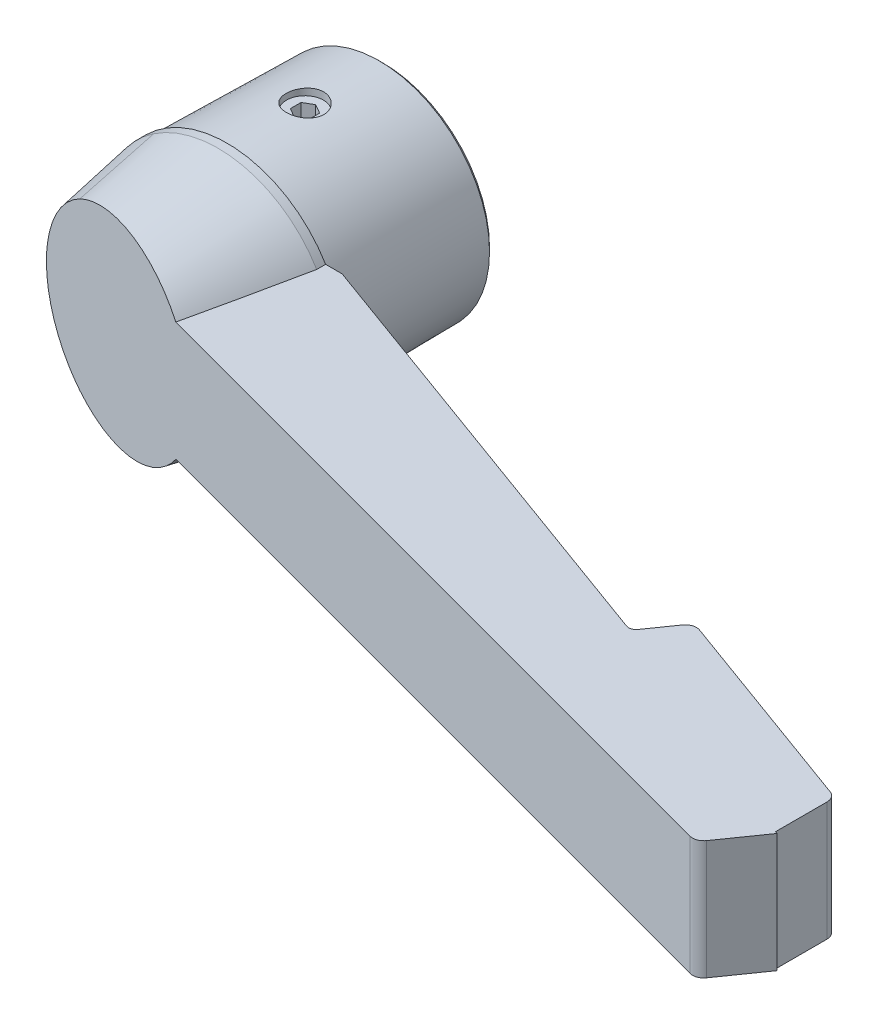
ISO-10303-21;
HEADER;
FILE_DESCRIPTION(('STEP AP214'),'2;1');
FILE_NAME('part.step','',(''),(''),'','','');
FILE_SCHEMA(('AUTOMOTIVE_DESIGN { 1 0 10303 214 1 1 1 1 }'));
ENDSEC;
DATA;
#1=APPLICATION_CONTEXT('core data for automotive mechanical design processes');
#2=APPLICATION_PROTOCOL_DEFINITION('international standard','automotive_design',2000,#1);
#3=PRODUCT_CONTEXT('',#1,'mechanical');
#4=PRODUCT('Part','Part','',(#3));
#5=PRODUCT_RELATED_PRODUCT_CATEGORY('part','',(#4));
#6=PRODUCT_DEFINITION_FORMATION('','',#4);
#7=PRODUCT_DEFINITION_CONTEXT('part definition',#1,'design');
#8=PRODUCT_DEFINITION('design','',#6,#7);
#9=PRODUCT_DEFINITION_SHAPE('','',#8);
#10=(LENGTH_UNIT() NAMED_UNIT(*) SI_UNIT(.MILLI.,.METRE.));
#11=(NAMED_UNIT(*) PLANE_ANGLE_UNIT() SI_UNIT($,.RADIAN.));
#12=(NAMED_UNIT(*) SI_UNIT($,.STERADIAN.) SOLID_ANGLE_UNIT());
#13=UNCERTAINTY_MEASURE_WITH_UNIT(LENGTH_MEASURE(1.E-05),#10,'distance_accuracy_value','');
#14=(GEOMETRIC_REPRESENTATION_CONTEXT(3) GLOBAL_UNCERTAINTY_ASSIGNED_CONTEXT((#13)) GLOBAL_UNIT_ASSIGNED_CONTEXT((#10,
#11,#12)) REPRESENTATION_CONTEXT('',''));
#15=CARTESIAN_POINT('',(0.,0.,0.));
#16=DIRECTION('',(0.,0.,1.));
#17=DIRECTION('',(1.,0.,0.));
#18=AXIS2_PLACEMENT_3D('',#15,#16,#17);
#19=CARTESIAN_POINT('',(0.,20.,10.5));
#20=DIRECTION('',(0.,-1.,0.));
#21=DIRECTION('',(1.,0.,0.));
#22=AXIS2_PLACEMENT_3D('',#19,#20,#21);
#23=CYLINDRICAL_SURFACE('',#22,2.5);
#24=CARTESIAN_POINT('',(0.,6.75,10.5));
#25=DIRECTION('',(0.,-1.,0.));
#26=DIRECTION('',(0.,0.,-1.));
#27=AXIS2_PLACEMENT_3D('',#24,#25,#26);
#28=CIRCLE('',#27,2.5);
#29=CARTESIAN_POINT('',(0.,6.75,8.));
#30=VERTEX_POINT('',#29);
#31=EDGE_CURVE('E259',#30,#30,#28,.T.);
#32=ORIENTED_EDGE('',*,*,#31,.F.);
#33=EDGE_LOOP('',(#32));
#34=FACE_BOUND('',#33,.T.);
#35=CARTESIAN_POINT('',(0.,6.,10.5));
#36=DIRECTION('',(0.,-1.,0.));
#37=DIRECTION('',(1.,0.,0.));
#38=AXIS2_PLACEMENT_3D('',#35,#36,#37);
#39=CIRCLE('',#38,2.5);
#40=CARTESIAN_POINT('',(2.5,6.,10.5));
#41=VERTEX_POINT('',#40);
#42=EDGE_CURVE('E19',#41,#41,#39,.T.);
#43=ORIENTED_EDGE('',*,*,#42,.T.);
#44=EDGE_LOOP('',(#43));
#45=FACE_BOUND('',#44,.T.);
#46=ADVANCED_FACE('F15',(#34,#45),#23,.F.);
#47=CARTESIAN_POINT('',(0.,0.,22.2000000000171));
#48=DIRECTION('',(0.,0.,-1.));
#49=DIRECTION('',(1.,0.,0.));
#50=AXIS2_PLACEMENT_3D('',#47,#48,#49);
#51=CONICAL_SURFACE('',#50,15.5,0.174532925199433);
#52=CARTESIAN_POINT('',(6.69671358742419,-8.,50.9367970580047));
#53=CARTESIAN_POINT('',(6.79490205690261,-8.,50.5793356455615));
#54=CARTESIAN_POINT('',(6.89192331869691,-8.,50.2215557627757));
#55=CARTESIAN_POINT('',(7.08386884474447,-8.,49.5054367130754));
#56=CARTESIAN_POINT('',(7.17879312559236,-8.,49.1470975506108));
#57=CARTESIAN_POINT('',(7.46077212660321,-8.,48.0713750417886));
#58=CARTESIAN_POINT('',(7.645040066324,-8.,47.3532608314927));
#59=CARTESIAN_POINT('',(8.00754020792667,-8.,45.9155943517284));
#60=CARTESIAN_POINT('',(8.18577302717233,-8.,45.1960422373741));
#61=CARTESIAN_POINT('',(8.53725555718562,-8.,43.7557161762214));
#62=CARTESIAN_POINT('',(8.71050521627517,-8.,43.0349422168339));
#63=CARTESIAN_POINT('',(9.22393978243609,-8.,40.8714650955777));
#64=CARTESIAN_POINT('',(9.55789107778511,-8.,39.4272828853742));
#65=CARTESIAN_POINT('',(10.2136694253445,-8.,36.5361452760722));
#66=CARTESIAN_POINT('',(10.5354961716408,-8.,35.0891898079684));
#67=CARTESIAN_POINT('',(10.9838570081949,-8.,33.0423725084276));
#68=CARTESIAN_POINT('',(11.1142417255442,-8.,32.4433511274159));
#69=CARTESIAN_POINT('',(11.3735695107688,-8.,31.2450016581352));
#70=CARTESIAN_POINT('',(11.5025125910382,-8.,30.6456735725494));
#71=CARTESIAN_POINT('',(11.8874029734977,-8.,28.8472148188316));
#72=CARTESIAN_POINT('',(12.1413989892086,-8.,27.6476665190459));
#73=CARTESIAN_POINT('',(12.8235681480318,-8.,24.397319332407));
#74=CARTESIAN_POINT('',(13.2476233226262,-8.,22.3456567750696));
#75=CARTESIAN_POINT('',(14.0863697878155,-8.,18.2404130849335));
#76=CARTESIAN_POINT('',(14.5010610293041,-8.,16.1868319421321));
#77=CARTESIAN_POINT('',(15.3231228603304,-8.,12.0785455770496));
#78=CARTESIAN_POINT('',(15.7304946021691,-8.,10.0238405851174));
#79=CARTESIAN_POINT('',(16.3372370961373,-8.,6.94094928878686));
#80=CARTESIAN_POINT('',(16.5387641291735,-8.,5.91318648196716));
#81=CARTESIAN_POINT('',(16.9405211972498,-8.,3.85740810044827));
#82=CARTESIAN_POINT('',(17.1407512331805,-8.,2.82939252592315));
#83=CARTESIAN_POINT('',(17.3404031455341,-8.,1.80126463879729));
#84=B_SPLINE_CURVE_WITH_KNOTS('',3,(#52,#53,#54,#55,#56,#57,#58,#59,#60,#61,#62,#63,#64,#65,#66,
#67,#68,#69,#70,#71,#72,#73,#74,#75,#76,#77,#78,#79,#80,#81,#82,#83),.UNSPECIFIED.,.F.,.F.,(4,2,
2,2,2,2,2,2,2,2,2,2,2,2,2,4),(0.,1.11209943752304,2.22419007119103,4.44829097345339,
6.67216366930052,8.89605941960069,13.3428497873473,17.7897522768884,19.6288923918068,
21.4680166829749,25.1464398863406,31.4314914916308,37.7165760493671,44.0006623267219,
47.1426651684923,50.2846658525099),.UNSPECIFIED.);
#85=CARTESIAN_POINT('',(9.92449000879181,-8.,37.8109271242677));
#86=VERTEX_POINT('',#85);
#87=CARTESIAN_POINT('',(13.2759180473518,-8.,22.2000000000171));
#88=VERTEX_POINT('',#87);
#89=EDGE_CURVE('E24',#86,#88,#84,.T.);
#90=ORIENTED_EDGE('',*,*,#89,.F.);
#91=CARTESIAN_POINT('',(-0.625674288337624,0.,34.9846600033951));
#92=DIRECTION('',(-0.258764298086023,0.,0.965940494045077));
#93=DIRECTION('',(-0.965940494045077,0.,-0.258764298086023));
#94=AXIS2_PLACEMENT_3D('',#91,#92,#93);
#95=ELLIPSE('',#94,13.7127696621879,13.2309340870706);
#96=CARTESIAN_POINT('',(-7.73502308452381,-11.1632923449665,33.0801476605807));
#97=VERTEX_POINT('',#96);
#98=EDGE_CURVE('E330',#86,#97,#95,.F.);
#99=ORIENTED_EDGE('',*,*,#98,.T.);
#100=CARTESIAN_POINT('',(-8.67128316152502,-12.847523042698,22.2000000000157));
#101=CARTESIAN_POINT('',(-8.51502445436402,-12.5665987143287,24.0147816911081));
#102=CARTESIAN_POINT('',(-8.20250704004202,-12.0047500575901,27.6443450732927));
#103=CARTESIAN_POINT('',(-7.73373091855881,-11.1619770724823,33.0886901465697));
#104=CARTESIAN_POINT('',(-7.42121350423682,-10.6001284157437,36.7182535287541));
#105=CARTESIAN_POINT('',(-7.26495479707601,-10.3192040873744,38.5330352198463));
#106=(BOUNDED_CURVE() B_SPLINE_CURVE(3,(#100,#101,#102,#103,#104,#105),.UNSPECIFIED.,.F.,
.F.) B_SPLINE_CURVE_WITH_KNOTS((4,1,1,4),(0.,0.333333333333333,0.666666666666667,1.),
.UNSPECIFIED.) CURVE() GEOMETRIC_REPRESENTATION_ITEM() RATIONAL_B_SPLINE_CURVE((1.,1.,1.,1.,1.,1.)) REPRESENTATION_ITEM(''));
#107=CARTESIAN_POINT('',(-8.67128316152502,-12.847523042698,22.2000000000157));
#108=VERTEX_POINT('',#107);
#109=EDGE_CURVE('E367',#97,#108,#106,.F.);
#110=ORIENTED_EDGE('',*,*,#109,.T.);
#111=CARTESIAN_POINT('',(0.,0.,22.2000000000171));
#112=DIRECTION('',(0.,0.,-1.));
#113=DIRECTION('',(1.,0.,0.));
#114=AXIS2_PLACEMENT_3D('',#111,#112,#113);
#115=CIRCLE('',#114,15.5);
#116=EDGE_CURVE('E380',#88,#108,#115,.T.);
#117=ORIENTED_EDGE('',*,*,#116,.F.);
#118=EDGE_LOOP('',(#90,#99,#110,#117));
#119=FACE_BOUND('',#118,.T.);
#120=ADVANCED_FACE('F382',(#119),#51,.T.);
#121=CARTESIAN_POINT('',(-7.26495479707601,10.3192040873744,38.5330352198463));
#122=CARTESIAN_POINT('',(-7.42121350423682,10.6001284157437,36.7182535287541));
#123=CARTESIAN_POINT('',(-7.73373091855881,11.1619770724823,33.0886901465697));
#124=CARTESIAN_POINT('',(-8.20250704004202,12.0047500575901,27.6443450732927));
#125=CARTESIAN_POINT('',(-8.51502445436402,12.5665987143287,24.0147816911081));
#126=CARTESIAN_POINT('',(-8.67128316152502,12.847523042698,22.2000000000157));
#127=(BOUNDED_CURVE() B_SPLINE_CURVE(3,(#121,#122,#123,#124,#125,#126),.UNSPECIFIED.,.F.,
.F.) B_SPLINE_CURVE_WITH_KNOTS((4,1,1,4),(0.,0.333333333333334,0.666666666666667,1.),
.UNSPECIFIED.) CURVE() GEOMETRIC_REPRESENTATION_ITEM() RATIONAL_B_SPLINE_CURVE((1.,1.,1.,1.,1.,1.)) REPRESENTATION_ITEM(''));
#128=CARTESIAN_POINT('',(-8.67128316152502,12.847523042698,22.2000000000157));
#129=VERTEX_POINT('',#128);
#130=CARTESIAN_POINT('',(-7.73473820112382,11.1632840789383,33.0802239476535));
#131=VERTEX_POINT('',#130);
#132=EDGE_CURVE('E422',#129,#131,#127,.F.);
#133=ORIENTED_EDGE('',*,*,#132,.T.);
#134=CARTESIAN_POINT('',(-0.625674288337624,0.,34.9846600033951));
#135=DIRECTION('',(-0.258764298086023,0.,0.965940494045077));
#136=DIRECTION('',(-0.965940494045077,0.,-0.258764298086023));
#137=AXIS2_PLACEMENT_3D('',#134,#135,#136);
#138=ELLIPSE('',#137,13.7127696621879,13.2309340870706);
#139=CARTESIAN_POINT('',(9.92449000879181,8.,37.8109271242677));
#140=VERTEX_POINT('',#139);
#141=EDGE_CURVE('E39',#131,#140,#138,.F.);
#142=ORIENTED_EDGE('',*,*,#141,.T.);
#143=CARTESIAN_POINT('',(6.69671358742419,8.,50.9367970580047));
#144=CARTESIAN_POINT('',(6.79490205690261,8.,50.5793356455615));
#145=CARTESIAN_POINT('',(6.89192331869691,8.,50.2215557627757));
#146=CARTESIAN_POINT('',(7.08386884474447,8.,49.5054367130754));
#147=CARTESIAN_POINT('',(7.17879312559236,8.,49.1470975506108));
#148=CARTESIAN_POINT('',(7.46077212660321,8.,48.0713750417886));
#149=CARTESIAN_POINT('',(7.645040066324,8.,47.3532608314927));
#150=CARTESIAN_POINT('',(8.00754020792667,8.,45.9155943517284));
#151=CARTESIAN_POINT('',(8.18577302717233,8.,45.1960422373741));
#152=CARTESIAN_POINT('',(8.53725555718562,8.,43.7557161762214));
#153=CARTESIAN_POINT('',(8.71050521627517,8.,43.0349422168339));
#154=CARTESIAN_POINT('',(9.22393978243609,8.,40.8714650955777));
#155=CARTESIAN_POINT('',(9.55789107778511,8.,39.4272828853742));
#156=CARTESIAN_POINT('',(10.2136694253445,8.,36.5361452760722));
#157=CARTESIAN_POINT('',(10.5354961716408,8.,35.0891898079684));
#158=CARTESIAN_POINT('',(10.9838570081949,8.,33.0423725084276));
#159=CARTESIAN_POINT('',(11.1142417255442,8.,32.4433511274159));
#160=CARTESIAN_POINT('',(11.3735695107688,8.,31.2450016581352));
#161=CARTESIAN_POINT('',(11.5025125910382,8.,30.6456735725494));
#162=CARTESIAN_POINT('',(11.8874029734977,8.,28.8472148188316));
#163=CARTESIAN_POINT('',(12.1413989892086,8.,27.6476665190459));
#164=CARTESIAN_POINT('',(12.8235681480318,8.,24.397319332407));
#165=CARTESIAN_POINT('',(13.2476233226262,8.,22.3456567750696));
#166=CARTESIAN_POINT('',(14.0863697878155,8.,18.2404130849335));
#167=CARTESIAN_POINT('',(14.5010610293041,8.,16.1868319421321));
#168=CARTESIAN_POINT('',(15.3231228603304,8.,12.0785455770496));
#169=CARTESIAN_POINT('',(15.7304946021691,8.,10.0238405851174));
#170=CARTESIAN_POINT('',(16.3372370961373,8.,6.94094928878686));
#171=CARTESIAN_POINT('',(16.5387641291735,8.,5.91318648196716));
#172=CARTESIAN_POINT('',(16.9405211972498,8.,3.85740810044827));
#173=CARTESIAN_POINT('',(17.1407512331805,8.,2.82939252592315));
#174=CARTESIAN_POINT('',(17.3404031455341,8.,1.80126463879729));
#175=B_SPLINE_CURVE_WITH_KNOTS('',3,(#143,#144,#145,#146,#147,#148,#149,#150,#151,#152,#153,
#154,#155,#156,#157,#158,#159,#160,#161,#162,#163,#164,#165,#166,#167,#168,#169,#170,#171,#172,
#173,#174),.UNSPECIFIED.,.F.,.F.,(4,2,2,2,2,2,2,2,2,2,2,2,2,2,2,4),(0.,1.11209943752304,
2.22419007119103,4.44829097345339,6.67216366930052,8.89605941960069,13.3428497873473,
17.7897522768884,19.6288923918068,21.4680166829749,25.1464398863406,31.4314914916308,
37.7165760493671,44.0006623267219,47.1426651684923,50.2846658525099),.UNSPECIFIED.);
#176=CARTESIAN_POINT('',(13.2759180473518,8.,22.2000000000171));
#177=VERTEX_POINT('',#176);
#178=EDGE_CURVE('E398',#140,#177,#175,.T.);
#179=ORIENTED_EDGE('',*,*,#178,.T.);
#180=EDGE_CURVE('E377',#129,#177,#115,.T.);
#181=ORIENTED_EDGE('',*,*,#180,.F.);
#182=EDGE_LOOP('',(#133,#142,#179,#181));
#183=FACE_BOUND('',#182,.T.);
#184=ADVANCED_FACE('F338',(#183),#51,.T.);
#185=CARTESIAN_POINT('',(-12.6200452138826,0.,38.5330352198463));
#186=CARTESIAN_POINT('',(-12.9400401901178,0.,36.7182535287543));
#187=CARTESIAN_POINT('',(-13.5800301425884,0.,33.0886901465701));
#188=CARTESIAN_POINT('',(-14.5400150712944,0.,27.6443450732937));
#189=CARTESIAN_POINT('',(-15.1800050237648,0.,24.0147816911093));
#190=CARTESIAN_POINT('',(-15.5,0.,22.2000000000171));
#191=CARTESIAN_POINT('',(-12.6200452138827,-0.0040371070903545,38.5330352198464));
#192=CARTESIAN_POINT('',(-12.9400401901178,-0.00415016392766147,36.7182535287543));
#193=CARTESIAN_POINT('',(-13.5800301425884,-0.00437610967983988,33.08869014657));
#194=CARTESIAN_POINT('',(-14.5400150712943,-0.00471452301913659,27.6443450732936));
#195=CARTESIAN_POINT('',(-15.1800050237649,-0.00493979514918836,24.0147816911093));
#196=CARTESIAN_POINT('',(-15.5000000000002,-0.00505234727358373,22.2000000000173));
#197=CARTESIAN_POINT('',(-12.6200355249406,-0.0242297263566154,38.5330352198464));
#198=CARTESIAN_POINT('',(-12.9400288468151,-0.0249082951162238,36.7182612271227));
#199=CARTESIAN_POINT('',(-13.58001684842,-0.0262644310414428,33.0887055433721));
#200=CARTESIAN_POINT('',(-14.5400008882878,-0.0282956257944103,27.6443604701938));
#201=CARTESIAN_POINT('',(-15.1799916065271,-0.0296477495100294,24.014789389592));
#202=CARTESIAN_POINT('',(-15.4999876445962,-0.030323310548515,22.2000000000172));
#203=CARTESIAN_POINT('',(-12.6195689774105,-0.186241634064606,38.5330352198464));
#204=CARTESIAN_POINT('',(-12.9395389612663,-0.191459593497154,36.7183124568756));
#205=CARTESIAN_POINT('',(-13.5794893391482,-0.201888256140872,33.0888080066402));
#206=CARTESIAN_POINT('',(-14.5394305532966,-0.217509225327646,27.6444629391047));
#207=CARTESIAN_POINT('',(-15.1794017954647,-0.227908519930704,24.0148406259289));
#208=CARTESIAN_POINT('',(-15.4993926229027,-0.233104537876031,22.2000000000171));
#209=CARTESIAN_POINT('',(-12.6077244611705,-0.733589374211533,38.5330352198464));
#210=CARTESIAN_POINT('',(-12.9273012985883,-0.754162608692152,36.7184792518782));
#211=CARTESIAN_POINT('',(-13.5664951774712,-0.795286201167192,33.0891416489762));
#212=CARTESIAN_POINT('',(-14.5253470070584,-0.856899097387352,27.6447966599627));
#213=CARTESIAN_POINT('',(-15.1646222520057,-0.897926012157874,24.0150075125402));
#214=CARTESIAN_POINT('',(-15.4842799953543,-0.918428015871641,22.2000000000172));
#215=CARTESIAN_POINT('',(-12.257156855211,-4.86199331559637,38.5330352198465));
#216=CARTESIAN_POINT('',(-12.5656638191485,-4.99946459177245,36.7195776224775));
#217=CARTESIAN_POINT('',(-13.1829012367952,-5.27450872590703,33.0913402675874));
#218=CARTESIAN_POINT('',(-14.1090909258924,-5.68722955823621,27.6469980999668));
#219=CARTESIAN_POINT('',(-14.7267736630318,-5.96248013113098,24.0161091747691));
#220=CARTESIAN_POINT('',(-15.0357273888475,-6.10015648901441,22.2000000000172));
#221=CARTESIAN_POINT('',(-10.1755608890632,-8.27007108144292,38.5330352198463));
#222=CARTESIAN_POINT('',(-10.4197161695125,-8.5008328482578,36.7193857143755));
#223=CARTESIAN_POINT('',(-10.9081592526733,-8.96251148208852,33.0909559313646));
#224=CARTESIAN_POINT('',(-11.6409932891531,-9.65527924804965,27.6466129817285));
#225=CARTESIAN_POINT('',(-12.1296625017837,-10.117291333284,24.0159163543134));
#226=CARTESIAN_POINT('',(-12.3740636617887,-10.348375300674,22.2000000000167));
#227=CARTESIAN_POINT('',(-7.26495479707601,-10.3192040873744,38.5330352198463));
#228=CARTESIAN_POINT('',(-7.42121350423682,-10.6001284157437,36.7182535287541));
#229=CARTESIAN_POINT('',(-7.73373091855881,-11.1619770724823,33.0886901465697));
#230=CARTESIAN_POINT('',(-8.20250704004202,-12.0047500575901,27.6443450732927));
#231=CARTESIAN_POINT('',(-8.51502445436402,-12.5665987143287,24.0147816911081));
#232=CARTESIAN_POINT('',(-8.67128316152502,-12.847523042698,22.2000000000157));
#233=(BOUNDED_SURFACE() B_SPLINE_SURFACE(3,3,((#185,#186,#187,#188,#189,#190),(#191,#192,#193,
#194,#195,#196),(#197,#198,#199,#200,#201,#202),(#203,#204,#205,#206,#207,#208),(#209,#210,#211,
#212,#213,#214),(#215,#216,#217,#218,#219,#220),(#221,#222,#223,#224,#225,#226),(#227,#228,#229,
#230,#231,#232)),.UNSPECIFIED.,.F.,.F.,.F.) B_SPLINE_SURFACE_WITH_KNOTS((4,1,1,1,1,4),(4,1,1,4),
(0.,0.00104166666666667,0.00520833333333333,0.0416666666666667,0.140625,1.),(0.,
0.333333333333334,0.666666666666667,1.),
.UNSPECIFIED.) GEOMETRIC_REPRESENTATION_ITEM() RATIONAL_B_SPLINE_SURFACE(((1.,1.,1.,1.,1.,1.),
(0.99992194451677,0.999921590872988,0.999920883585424,0.999919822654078,0.999919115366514,
0.999918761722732),(0.999532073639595,0.999529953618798,0.999525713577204,0.999519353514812,
0.999515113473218,0.999512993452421),(0.996429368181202,0.996413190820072,0.996380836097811,
0.996332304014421,0.99629994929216,0.99628377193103),(0.986460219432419,0.986398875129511,
0.986276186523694,0.98609215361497,0.985969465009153,0.985908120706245),(0.925505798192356,
0.925168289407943,0.924493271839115,0.923480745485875,0.922805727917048,0.922468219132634),
(0.935604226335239,0.935312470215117,0.934728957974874,0.933853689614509,0.933270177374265,
0.932978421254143),(1.,1.,1.,1.,1.,1.))) REPRESENTATION_ITEM('') SURFACE());
#234=CARTESIAN_POINT('',(-13.8713937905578,0.,31.4362847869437));
#235=CARTESIAN_POINT('',(-13.8714029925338,-0.241796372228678,31.4362823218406));
#236=CARTESIAN_POINT('',(-13.8647586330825,-0.483591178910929,31.4380622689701));
#237=CARTESIAN_POINT('',(-13.8382302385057,-0.966372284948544,31.4451689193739));
#238=CARTESIAN_POINT('',(-13.8183477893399,-1.20735867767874,31.4504951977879));
#239=CARTESIAN_POINT('',(-13.7654117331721,-1.6877658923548,31.4646761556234));
#240=CARTESIAN_POINT('',(-13.7323586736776,-1.92718677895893,31.4735306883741));
#241=CARTESIAN_POINT('',(-13.6533388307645,-2.40294416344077,31.4946991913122));
#242=CARTESIAN_POINT('',(-13.6074136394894,-2.63928807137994,31.507002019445));
#243=CARTESIAN_POINT('',(-13.5027782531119,-3.10892711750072,31.5350326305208));
#244=CARTESIAN_POINT('',(-13.444068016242,-3.34222224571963,31.5507604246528));
#245=CARTESIAN_POINT('',(-13.314092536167,-3.80501638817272,31.5855793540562));
#246=CARTESIAN_POINT('',(-13.2428273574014,-4.03451542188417,31.604670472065));
#247=CARTESIAN_POINT('',(-13.0492723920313,-4.60269876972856,31.6565216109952));
#248=CARTESIAN_POINT('',(-12.9192854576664,-4.93860773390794,31.6913436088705));
#249=CARTESIAN_POINT('',(-12.6326303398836,-5.59819101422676,31.7681352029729));
#250=CARTESIAN_POINT('',(-12.4759465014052,-5.9218580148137,31.8101089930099));
#251=CARTESIAN_POINT('',(-12.1370536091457,-6.55493384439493,31.9008944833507));
#252=CARTESIAN_POINT('',(-11.9548205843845,-6.86432891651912,31.949712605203));
#253=CARTESIAN_POINT('',(-11.5664680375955,-7.46638872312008,32.053747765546));
#254=CARTESIAN_POINT('',(-11.3603615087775,-7.75906242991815,32.1089613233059));
#255=CARTESIAN_POINT('',(-10.9852122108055,-8.24849268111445,32.2094594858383));
#256=CARTESIAN_POINT('',(-10.8214334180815,-8.44960374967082,32.2533339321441));
#257=CARTESIAN_POINT('',(-10.4826874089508,-8.84151146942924,32.3440800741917));
#258=CARTESIAN_POINT('',(-10.3077190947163,-9.03230710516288,32.3909520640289));
#259=CARTESIAN_POINT('',(-9.94727193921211,-9.40297523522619,32.4875116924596));
#260=CARTESIAN_POINT('',(-9.76179200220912,-9.58284658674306,32.5371996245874));
#261=CARTESIAN_POINT('',(-9.38090974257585,-9.93121874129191,32.6392335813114));
#262=CARTESIAN_POINT('',(-9.18550107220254,-10.0997121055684,32.6915813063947));
#263=CARTESIAN_POINT('',(-8.78560597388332,-10.424688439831,32.7987085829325));
#264=CARTESIAN_POINT('',(-8.58112026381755,-10.5811723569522,32.8534879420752));
#265=CARTESIAN_POINT('',(-8.16384201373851,-10.8816717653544,32.9652719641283));
#266=CARTESIAN_POINT('',(-7.95105141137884,-11.025690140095,33.0222761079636));
#267=CARTESIAN_POINT('',(-7.73445331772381,-11.16327581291,33.0803002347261));
#268=B_SPLINE_CURVE_WITH_KNOTS('',3,(#234,#235,#236,#237,#238,#239,#240,#241,#242,#243,#244,
#245,#246,#247,#248,#249,#250,#251,#252,#253,#254,#255,#256,#257,#258,#259,#260,#261,#262,#263,
#264,#265,#266,#267),.UNSPECIFIED.,.F.,.F.,(4,2,2,2,2,2,2,2,2,2,2,2,2,2,2,2,4),(0.,
0.725288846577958,1.4504908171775,2.1756626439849,2.8985178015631,3.62137532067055,
4.3442291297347,5.4284691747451,6.51334721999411,7.59925002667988,8.68456458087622,
9.47327975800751,10.2620724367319,11.0509474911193,11.8403334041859,12.6296569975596,
13.4187975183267),.UNSPECIFIED.);
#269=CARTESIAN_POINT('',(-13.8713937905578,0.,31.4362847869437));
#270=VERTEX_POINT('',#269);
#271=EDGE_CURVE('E328',#270,#97,#268,.T.);
#272=DIRECTION('',(0.173648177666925,0.,0.984807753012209));
#273=VECTOR('',#272,1.);
#274=CARTESIAN_POINT('',(-14.0600226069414,0.,30.3665176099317));
#275=LINE('',#274,#273);
#276=CARTESIAN_POINT('',(-15.5,0.,22.2000000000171));
#277=VERTEX_POINT('',#276);
#278=EDGE_CURVE('E427',#277,#270,#275,.T.);
#279=EDGE_CURVE('E498',#108,#277,#115,.T.);
#280=ORIENTED_EDGE('',*,*,#271,.F.);
#281=ORIENTED_EDGE('',*,*,#278,.F.);
#282=ORIENTED_EDGE('',*,*,#279,.F.);
#283=ORIENTED_EDGE('',*,*,#109,.F.);
#284=EDGE_LOOP('',(#280,#281,#282,#283));
#285=FACE_BOUND('',#284,.T.);
#286=ADVANCED_FACE('F332',(#285),#233,.F.);
#287=CARTESIAN_POINT('',(-7.26495479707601,10.3192040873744,38.5330352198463));
#288=CARTESIAN_POINT('',(-7.42121350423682,10.6001284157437,36.7182535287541));
#289=CARTESIAN_POINT('',(-7.73373091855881,11.1619770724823,33.0886901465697));
#290=CARTESIAN_POINT('',(-8.20250704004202,12.0047500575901,27.6443450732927));
#291=CARTESIAN_POINT('',(-8.51502445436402,12.5665987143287,24.0147816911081));
#292=CARTESIAN_POINT('',(-8.67128316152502,12.847523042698,22.2000000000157));
#293=CARTESIAN_POINT('',(-10.1755608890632,8.27007108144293,38.5330352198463));
#294=CARTESIAN_POINT('',(-10.4197161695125,8.5008328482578,36.7193857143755));
#295=CARTESIAN_POINT('',(-10.908159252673,8.96251148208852,33.0909559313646));
#296=CARTESIAN_POINT('',(-11.6409932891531,9.65527924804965,27.6466129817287));
#297=CARTESIAN_POINT('',(-12.1296625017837,10.117291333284,24.0159163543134));
#298=CARTESIAN_POINT('',(-12.3740636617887,10.348375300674,22.2000000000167));
#299=CARTESIAN_POINT('',(-12.257156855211,4.86199331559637,38.5330352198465));
#300=CARTESIAN_POINT('',(-12.5656638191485,4.99946459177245,36.7195776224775));
#301=CARTESIAN_POINT('',(-13.1829012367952,5.27450872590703,33.0913402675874));
#302=CARTESIAN_POINT('',(-14.1090909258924,5.68722955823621,27.6469980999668));
#303=CARTESIAN_POINT('',(-14.7267736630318,5.96248013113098,24.0161091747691));
#304=CARTESIAN_POINT('',(-15.0357273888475,6.10015648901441,22.2000000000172));
#305=CARTESIAN_POINT('',(-12.6077244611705,0.733589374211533,38.5330352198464));
#306=CARTESIAN_POINT('',(-12.9273012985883,0.754162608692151,36.7184792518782));
#307=CARTESIAN_POINT('',(-13.5664951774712,0.79528620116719,33.0891416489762));
#308=CARTESIAN_POINT('',(-14.5253470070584,0.856899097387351,27.6447966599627));
#309=CARTESIAN_POINT('',(-15.1646222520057,0.897926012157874,24.0150075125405));
#310=CARTESIAN_POINT('',(-15.4842799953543,0.918428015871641,22.2000000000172));
#311=CARTESIAN_POINT('',(-12.6195689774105,0.186241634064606,38.5330352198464));
#312=CARTESIAN_POINT('',(-12.9395389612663,0.191459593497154,36.7183124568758));
#313=CARTESIAN_POINT('',(-13.5794893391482,0.201888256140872,33.0888080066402));
#314=CARTESIAN_POINT('',(-14.5394305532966,0.217509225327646,27.6444629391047));
#315=CARTESIAN_POINT('',(-15.1794017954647,0.227908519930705,24.0148406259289));
#316=CARTESIAN_POINT('',(-15.4993926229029,0.233104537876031,22.2000000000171));
#317=CARTESIAN_POINT('',(-12.6200355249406,0.0242297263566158,38.5330352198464));
#318=CARTESIAN_POINT('',(-12.9400288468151,0.0249082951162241,36.7182612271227));
#319=CARTESIAN_POINT('',(-13.58001684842,0.0262644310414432,33.0887055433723));
#320=CARTESIAN_POINT('',(-14.5400008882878,0.0282956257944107,27.6443604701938));
#321=CARTESIAN_POINT('',(-15.1799916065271,0.0296477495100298,24.014789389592));
#322=CARTESIAN_POINT('',(-15.4999876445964,0.0303233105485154,22.2000000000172));
#323=CARTESIAN_POINT('',(-12.6200452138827,0.0040371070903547,38.5330352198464));
#324=CARTESIAN_POINT('',(-12.9400401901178,0.00415016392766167,36.7182535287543));
#325=CARTESIAN_POINT('',(-13.5800301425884,0.00437610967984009,33.08869014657));
#326=CARTESIAN_POINT('',(-14.5400150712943,0.00471452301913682,27.6443450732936));
#327=CARTESIAN_POINT('',(-15.1800050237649,0.00493979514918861,24.0147816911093));
#328=CARTESIAN_POINT('',(-15.5000000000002,0.00505234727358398,22.2000000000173));
#329=CARTESIAN_POINT('',(-12.6200452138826,0.,38.5330352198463));
#330=CARTESIAN_POINT('',(-12.9400401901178,0.,36.7182535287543));
#331=CARTESIAN_POINT('',(-13.5800301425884,0.,33.0886901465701));
#332=CARTESIAN_POINT('',(-14.5400150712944,0.,27.6443450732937));
#333=CARTESIAN_POINT('',(-15.1800050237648,0.,24.0147816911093));
#334=CARTESIAN_POINT('',(-15.5,0.,22.2000000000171));
#335=(BOUNDED_SURFACE() B_SPLINE_SURFACE(3,3,((#287,#288,#289,#290,#291,#292),(#293,#294,#295,
#296,#297,#298),(#299,#300,#301,#302,#303,#304),(#305,#306,#307,#308,#309,#310),(#311,#312,#313,
#314,#315,#316),(#317,#318,#319,#320,#321,#322),(#323,#324,#325,#326,#327,#328),(#329,#330,#331,
#332,#333,#334)),.UNSPECIFIED.,.F.,.F.,.F.) B_SPLINE_SURFACE_WITH_KNOTS((4,1,1,1,1,4),(4,1,1,4),
(0.,0.859375,0.958333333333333,0.994791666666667,0.998958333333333,1.),(0.,0.333333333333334,
0.666666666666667,1.),
.UNSPECIFIED.) GEOMETRIC_REPRESENTATION_ITEM() RATIONAL_B_SPLINE_SURFACE(((1.,1.,1.,1.,1.,1.),
(0.935604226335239,0.935312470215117,0.934728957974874,0.933853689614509,0.933270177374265,
0.932978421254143),(0.925505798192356,0.925168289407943,0.924493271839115,0.923480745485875,
0.922805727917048,0.922468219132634),(0.986460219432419,0.986398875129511,0.986276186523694,
0.98609215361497,0.985969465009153,0.985908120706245),(0.996429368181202,0.996413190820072,
0.996380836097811,0.996332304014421,0.99629994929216,0.99628377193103),(0.999532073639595,
0.999529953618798,0.999525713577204,0.999519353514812,0.999515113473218,0.999512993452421),
(0.99992194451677,0.999921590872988,0.999920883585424,0.999919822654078,0.999919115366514,
0.999918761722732),(1.,1.,1.,1.,1.,1.))) REPRESENTATION_ITEM('') SURFACE());
#336=CARTESIAN_POINT('',(-7.73445331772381,11.16327581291,33.0803002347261));
#337=CARTESIAN_POINT('',(-7.94181633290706,11.0315551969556,33.0247500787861));
#338=CARTESIAN_POINT('',(-8.14568995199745,10.8939400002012,32.9701346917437));
#339=CARTESIAN_POINT('',(-8.54584022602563,10.6072816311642,32.8629390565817));
#340=CARTESIAN_POINT('',(-8.74211579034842,10.458236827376,32.8103591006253));
#341=CARTESIAN_POINT('',(-9.12639961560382,10.1491122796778,32.707413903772));
#342=CARTESIAN_POINT('',(-9.31440755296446,9.9890321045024,32.6570487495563));
#343=CARTESIAN_POINT('',(-9.68153289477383,9.65826055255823,32.5587001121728));
#344=CARTESIAN_POINT('',(-9.86064948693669,9.48756820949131,32.510716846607));
#345=CARTESIAN_POINT('',(-10.209350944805,9.13606150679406,32.4173037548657));
#346=CARTESIAN_POINT('',(-10.3789363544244,8.95524772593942,32.371873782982));
#347=CARTESIAN_POINT('',(-10.7079764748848,8.58402204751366,32.2837277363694));
#348=CARTESIAN_POINT('',(-10.8674313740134,8.39361032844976,32.2410116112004));
#349=CARTESIAN_POINT('',(-11.2530550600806,7.90579913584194,32.1377074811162));
#350=CARTESIAN_POINT('',(-11.4725291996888,7.60267789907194,32.0789128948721));
#351=CARTESIAN_POINT('',(-11.8856174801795,6.97785842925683,31.9682513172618));
#352=CARTESIAN_POINT('',(-12.0792156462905,6.65614889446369,31.9163886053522));
#353=CARTESIAN_POINT('',(-12.4385902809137,5.99686014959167,31.8201162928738));
#354=CARTESIAN_POINT('',(-12.6043915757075,5.65929544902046,31.7757000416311));
#355=CARTESIAN_POINT('',(-12.9068239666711,4.97065986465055,31.6946818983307));
#356=CARTESIAN_POINT('',(-13.0434741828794,4.61959801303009,31.6580748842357));
#357=CARTESIAN_POINT('',(-13.2424532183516,4.03569088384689,31.6047706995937));
#358=CARTESIAN_POINT('',(-13.3137741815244,3.80608341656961,31.5856646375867));
#359=CARTESIAN_POINT('',(-13.4438475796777,3.34307335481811,31.5508194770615));
#360=CARTESIAN_POINT('',(-13.5026003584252,3.10967086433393,31.535080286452));
#361=CARTESIAN_POINT('',(-13.6073077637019,2.63981783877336,31.5070303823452));
#362=CARTESIAN_POINT('',(-13.6532626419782,2.40336736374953,31.4947196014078));
#363=CARTESIAN_POINT('',(-13.7323170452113,1.92747298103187,31.4735418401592));
#364=CARTESIAN_POINT('',(-13.765379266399,1.68802242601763,31.4646848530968));
#365=CARTESIAN_POINT('',(-13.8183307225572,1.20755162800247,31.4504997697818));
#366=CARTESIAN_POINT('',(-13.8382192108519,0.966531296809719,31.4451718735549));
#367=CARTESIAN_POINT('',(-13.8647563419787,0.483674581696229,31.4380628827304));
#368=CARTESIAN_POINT('',(-13.8714029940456,0.241838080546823,31.4362823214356));
#369=CARTESIAN_POINT('',(-13.8713937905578,0.,31.4362847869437));
#370=B_SPLINE_CURVE_WITH_KNOTS('',3,(#336,#337,#338,#339,#340,#341,#342,#343,#344,#345,#346,
#347,#348,#349,#350,#351,#352,#353,#354,#355,#356,#357,#358,#359,#360,#361,#362,#363,#364,#365,
#366,#367,#368,#369),.UNSPECIFIED.,.F.,.F.,(4,2,2,2,2,2,2,2,2,2,2,2,2,2,2,2,4),(0.,
0.755503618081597,1.51111528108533,2.26675649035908,3.02246660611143,3.77813355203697,
4.53378644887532,5.66879123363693,6.80449351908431,7.93917600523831,9.07311195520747,
9.79633250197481,10.5195332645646,11.2427198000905,11.9679835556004,12.693288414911,
13.4187023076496),.UNSPECIFIED.);
#371=EDGE_CURVE('E9',#131,#270,#370,.T.);
#372=EDGE_CURVE('E500',#277,#129,#115,.T.);
#373=ORIENTED_EDGE('',*,*,#371,.F.);
#374=ORIENTED_EDGE('',*,*,#132,.F.);
#375=ORIENTED_EDGE('',*,*,#372,.F.);
#376=ORIENTED_EDGE('',*,*,#278,.T.);
#377=EDGE_LOOP('',(#373,#374,#375,#376));
#378=FACE_BOUND('',#377,.T.);
#379=ADVANCED_FACE('F307',(#378),#335,.F.);
#380=CARTESIAN_POINT('',(-14.3421711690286,0.,0.));
#381=DIRECTION('',(0.,0.,1.));
#382=DIRECTION('',(-1.,0.,0.));
#383=AXIS2_PLACEMENT_3D('',#380,#381,#382);
#384=PLANE('',#383);
#385=DIRECTION('',(-1.,0.,0.));
#386=VECTOR('',#385,1.);
#387=CARTESIAN_POINT('',(6.,6.,0.));
#388=LINE('',#387,#386);
#389=CARTESIAN_POINT('',(6.,6.,0.));
#390=VERTEX_POINT('',#389);
#391=CARTESIAN_POINT('',(-6.,6.,0.));
#392=VERTEX_POINT('',#391);
#393=EDGE_CURVE('E463',#390,#392,#388,.T.);
#394=ORIENTED_EDGE('',*,*,#393,.T.);
#395=DIRECTION('',(0.,1.,0.));
#396=VECTOR('',#395,1.);
#397=CARTESIAN_POINT('',(-6.,-6.,0.));
#398=LINE('',#397,#396);
#399=CARTESIAN_POINT('',(-6.,-6.,0.));
#400=VERTEX_POINT('',#399);
#401=EDGE_CURVE('E32',#400,#392,#398,.T.);
#402=ORIENTED_EDGE('',*,*,#401,.F.);
#403=DIRECTION('',(1.,0.,0.));
#404=VECTOR('',#403,1.);
#405=CARTESIAN_POINT('',(-6.,-6.,0.));
#406=LINE('',#405,#404);
#407=CARTESIAN_POINT('',(6.,-6.,0.));
#408=VERTEX_POINT('',#407);
#409=EDGE_CURVE('E458',#400,#408,#406,.T.);
#410=ORIENTED_EDGE('',*,*,#409,.T.);
#411=DIRECTION('',(0.,-1.,0.));
#412=VECTOR('',#411,1.);
#413=CARTESIAN_POINT('',(6.,6.,0.));
#414=LINE('',#413,#412);
#415=EDGE_CURVE('E461',#390,#408,#414,.T.);
#416=ORIENTED_EDGE('',*,*,#415,.F.);
#417=EDGE_LOOP('',(#394,#402,#410,#416));
#418=FACE_BOUND('',#417,.T.);
#419=CARTESIAN_POINT('',(0.,0.,0.));
#420=DIRECTION('',(0.,0.,-1.));
#421=DIRECTION('',(1.,0.,0.));
#422=AXIS2_PLACEMENT_3D('',#419,#420,#421);
#423=CIRCLE('',#422,14.3421711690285);
#424=CARTESIAN_POINT('',(14.3421711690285,0.,0.));
#425=VERTEX_POINT('',#424);
#426=EDGE_CURVE('E477',#425,#425,#423,.T.);
#427=ORIENTED_EDGE('',*,*,#426,.T.);
#428=EDGE_LOOP('',(#427));
#429=FACE_BOUND('',#428,.T.);
#430=ADVANCED_FACE('F17',(#418,#429),#384,.F.);
#431=CARTESIAN_POINT('',(0.,0.,0.));
#432=DIRECTION('',(0.,0.,1.));
#433=DIRECTION('',(-1.,0.,0.));
#434=AXIS2_PLACEMENT_3D('',#431,#432,#433);
#435=CONICAL_SURFACE('',#434,14.3421711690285,0.785398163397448);
#436=CARTESIAN_POINT('',(0.,0.,0.499999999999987));
#437=DIRECTION('',(0.,0.,-1.));
#438=DIRECTION('',(1.,0.,0.));
#439=AXIS2_PLACEMENT_3D('',#436,#437,#438);
#440=CIRCLE('',#439,14.8421711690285);
#441=CARTESIAN_POINT('',(14.8421711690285,0.,0.499999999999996));
#442=VERTEX_POINT('',#441);
#443=EDGE_CURVE('E479',#442,#442,#440,.T.);
#444=ORIENTED_EDGE('',*,*,#443,.T.);
#445=EDGE_LOOP('',(#444));
#446=FACE_BOUND('',#445,.T.);
#447=ORIENTED_EDGE('',*,*,#426,.F.);
#448=EDGE_LOOP('',(#447));
#449=FACE_BOUND('',#448,.T.);
#450=ADVANCED_FACE('F474',(#446,#449),#435,.T.);
#451=CARTESIAN_POINT('',(0.,0.,0.499999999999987));
#452=DIRECTION('',(0.,0.,1.));
#453=DIRECTION('',(-1.,0.,0.));
#454=AXIS2_PLACEMENT_3D('',#451,#452,#453);
#455=CONICAL_SURFACE('',#454,14.8421711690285,0.0174532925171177);
#456=CARTESIAN_POINT('',(-1.78855543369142,14.8791207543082,8.7532689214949));
#457=CARTESIAN_POINT('',(-1.88629511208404,14.8691316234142,8.85335597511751));
#458=CARTESIAN_POINT('',(-1.97567787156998,14.8593180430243,8.96172591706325));
#459=CARTESIAN_POINT('',(-2.13516332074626,14.8413049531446,9.19205119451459));
#460=CARTESIAN_POINT('',(-2.20524937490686,14.833106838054,9.31401812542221));
#461=CARTESIAN_POINT('',(-2.32406407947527,14.8194463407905,9.56812455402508));
#462=CARTESIAN_POINT('',(-2.37279016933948,14.8139842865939,9.70026526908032));
#463=CARTESIAN_POINT('',(-2.44739942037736,14.8066303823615,9.97091107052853));
#464=CARTESIAN_POINT('',(-2.47328825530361,14.8047376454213,10.1094145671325));
#465=CARTESIAN_POINT('',(-2.50134982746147,14.8049472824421,10.3876168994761));
#466=CARTESIAN_POINT('',(-2.50372092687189,14.8070160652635,10.5272957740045));
#467=CARTESIAN_POINT('',(-2.48522530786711,14.8150463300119,10.8049924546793));
#468=CARTESIAN_POINT('',(-2.46435818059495,14.8210078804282,10.943010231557));
#469=CARTESIAN_POINT('',(-2.40014683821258,14.836316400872,11.2131000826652));
#470=CARTESIAN_POINT('',(-2.35686536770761,14.8456538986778,11.3451876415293));
#471=CARTESIAN_POINT('',(-2.24915182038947,14.8668552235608,11.6002186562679));
#472=CARTESIAN_POINT('',(-2.18471817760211,14.8787192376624,11.7231614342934));
#473=CARTESIAN_POINT('',(-2.03562850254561,14.9039893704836,11.9580093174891));
#474=CARTESIAN_POINT('',(-1.95074082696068,14.917412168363,12.0697655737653));
#475=CARTESIAN_POINT('',(-1.76350031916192,14.9443545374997,12.2775337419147));
#476=CARTESIAN_POINT('',(-1.66114633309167,14.957874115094,12.3735446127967));
#477=CARTESIAN_POINT('',(-1.44070382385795,14.9837787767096,12.5480019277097));
#478=CARTESIAN_POINT('',(-1.32247687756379,14.9961520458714,12.6262753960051));
#479=CARTESIAN_POINT('',(-1.07431821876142,15.018340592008,12.7618190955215));
#480=CARTESIAN_POINT('',(-0.944387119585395,15.0281560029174,12.81909042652));
#481=CARTESIAN_POINT('',(-0.677548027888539,15.0441361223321,12.910531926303));
#482=CARTESIAN_POINT('',(-0.540701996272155,15.0503285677,12.9448779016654));
#483=CARTESIAN_POINT('',(-0.263066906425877,15.0585287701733,12.9900947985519));
#484=CARTESIAN_POINT('',(-0.122278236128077,15.0605369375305,13.0009680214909));
#485=CARTESIAN_POINT('',(0.157114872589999,15.0601598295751,12.9989110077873));
#486=CARTESIAN_POINT('',(0.295721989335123,15.057836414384,12.9863159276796));
#487=CARTESIAN_POINT('',(0.568809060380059,15.0491579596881,12.9383755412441));
#488=CARTESIAN_POINT('',(0.703289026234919,15.0428029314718,12.9030302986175));
#489=CARTESIAN_POINT('',(0.9643231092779,15.0267126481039,12.8106805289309));
#490=CARTESIAN_POINT('',(1.0908795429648,15.0169783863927,12.7536823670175));
#491=CARTESIAN_POINT('',(1.33268944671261,14.9951062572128,12.6196817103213));
#492=CARTESIAN_POINT('',(1.44794194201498,14.9829681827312,12.5426774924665));
#493=CARTESIAN_POINT('',(1.66559866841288,14.9573085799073,12.3695940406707));
#494=CARTESIAN_POINT('',(1.76780132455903,14.9437701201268,12.2732637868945));
#495=CARTESIAN_POINT('',(1.95468311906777,14.9168088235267,12.0648658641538));
#496=CARTESIAN_POINT('',(2.03936117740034,14.9033859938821,11.9527972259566));
#497=CARTESIAN_POINT('',(2.18949331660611,14.8778788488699,11.7149342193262));
#498=CARTESIAN_POINT('',(2.25477603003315,14.8658070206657,11.5890302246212));
#499=CARTESIAN_POINT('',(2.36320207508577,14.8443408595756,11.3278104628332));
#500=CARTESIAN_POINT('',(2.40634680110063,14.8349463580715,11.1924952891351));
#501=CARTESIAN_POINT('',(2.46888423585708,14.8198011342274,10.9175154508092));
#502=CARTESIAN_POINT('',(2.48847882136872,14.8140196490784,10.7778984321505));
#503=CARTESIAN_POINT('',(2.50394458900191,14.8064455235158,10.4972533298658));
#504=CARTESIAN_POINT('',(2.49981768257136,14.8046525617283,10.3562253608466));
#505=CARTESIAN_POINT('',(2.46813641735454,14.8050533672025,10.0785888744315));
#506=CARTESIAN_POINT('',(2.44086919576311,14.8071986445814,9.94194740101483));
#507=CARTESIAN_POINT('',(2.36409026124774,14.8149344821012,9.67516987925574));
#508=CARTESIAN_POINT('',(2.31457815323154,14.8205251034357,9.54503394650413));
#509=CARTESIAN_POINT('',(2.19461510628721,14.8343438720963,9.29460121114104));
#510=CARTESIAN_POINT('',(2.12411754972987,14.8425778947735,9.17432708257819));
#511=CARTESIAN_POINT('',(1.96421405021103,14.8605838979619,8.94721070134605));
#512=CARTESIAN_POINT('',(1.87480668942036,14.8703559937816,8.84036945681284));
#513=CARTESIAN_POINT('',(1.67840202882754,14.8903216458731,8.64185989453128));
#514=CARTESIAN_POINT('',(1.57121361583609,14.9005187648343,8.55038093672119));
#515=CARTESIAN_POINT('',(1.34295209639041,14.9199525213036,8.38665977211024));
#516=CARTESIAN_POINT('',(1.22187878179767,14.9291891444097,8.31441785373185));
#517=CARTESIAN_POINT('',(0.968900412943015,14.9455832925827,8.1910869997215));
#518=CARTESIAN_POINT('',(0.83697019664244,14.9527358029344,8.14004896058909));
#519=CARTESIAN_POINT('',(0.566285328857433,14.9640481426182,8.06090176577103));
#520=CARTESIAN_POINT('',(0.427531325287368,14.9682082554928,8.032790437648));
#521=CARTESIAN_POINT('',(0.148529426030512,14.9730001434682,8.0005048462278));
#522=CARTESIAN_POINT('',(0.00830779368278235,14.9736646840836,7.99610828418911));
#523=CARTESIAN_POINT('',(-0.270896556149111,14.9714727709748,8.0107917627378));
#524=CARTESIAN_POINT('',(-0.409879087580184,14.9686157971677,8.02987527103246));
#525=CARTESIAN_POINT('',(-0.681965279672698,14.9597491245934,8.09079319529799));
#526=CARTESIAN_POINT('',(-0.815093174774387,14.953754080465,8.13252189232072));
#527=CARTESIAN_POINT('',(-1.0723808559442,14.9393425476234,8.23741959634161));
#528=CARTESIAN_POINT('',(-1.19654786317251,14.9309280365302,8.3005711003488));
#529=CARTESIAN_POINT('',(-1.40090153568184,14.915141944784,8.4268857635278));
#530=CARTESIAN_POINT('',(-1.48395771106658,14.9080950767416,8.48551143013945));
#531=CARTESIAN_POINT('',(-1.64232754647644,14.8937082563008,8.61239419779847));
#532=CARTESIAN_POINT('',(-1.71764108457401,14.8863682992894,8.68065145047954));
#533=CARTESIAN_POINT('',(-1.78855543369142,14.8791207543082,8.7532689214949));
#534=B_SPLINE_CURVE_WITH_KNOTS('',3,(#456,#457,#458,#459,#460,#461,#462,#463,#464,#465,#466,
#467,#468,#469,#470,#471,#472,#473,#474,#475,#476,#477,#478,#479,#480,#481,#482,#483,#484,#485,
#486,#487,#488,#489,#490,#491,#492,#493,#494,#495,#496,#497,#498,#499,#500,#501,#502,#503,#504,
#505,#506,#507,#508,#509,#510,#511,#512,#513,#514,#515,#516,#517,#518,#519,#520,#521,#522,#523,
#524,#525,#526,#527,#528,#529,#530,#531,#532,#533),.UNSPECIFIED.,.T.,.F.,(4,2,2,2,2,2,2,2,2,2,2,
2,2,2,2,2,2,2,2,2,2,2,2,2,2,2,2,2,2,2,2,2,2,2,2,2,2,2,4),(0.,0.420388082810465,
0.841137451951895,1.26193724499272,1.68263246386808,2.09977624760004,2.51692737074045,
2.93291702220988,3.34893747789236,3.76991127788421,4.19091289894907,4.61585860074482,
5.0407820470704,5.462408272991,5.88399315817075,6.29960338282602,6.7152124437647,
7.13069942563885,7.54622220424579,7.96753928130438,8.38888231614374,8.81384438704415,
9.23877968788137,9.6600457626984,10.0812778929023,10.4973583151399,10.9134461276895,
11.3304652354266,11.7475156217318,12.1693796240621,12.5912499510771,13.0141271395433,
13.4369642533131,13.8558307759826,14.274759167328,14.6917484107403,15.1083977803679,
15.4134026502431,15.718412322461),.UNSPECIFIED.);
#535=CARTESIAN_POINT('',(-1.78855543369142,14.8791207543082,8.7532689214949));
#536=VERTEX_POINT('',#535);
#537=EDGE_CURVE('E265',#536,#536,#534,.T.);
#538=ORIENTED_EDGE('',*,*,#537,.F.);
#539=EDGE_LOOP('',(#538));
#540=FACE_BOUND('',#539,.T.);
#541=CARTESIAN_POINT('',(0.,0.,21.));
#542=DIRECTION('',(0.,0.,-1.));
#543=DIRECTION('',(1.,0.,0.));
#544=AXIS2_PLACEMENT_3D('',#541,#542,#543);
#545=CIRCLE('',#544,15.199999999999);
#546=CARTESIAN_POINT('',(15.199999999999,0.,21.));
#547=VERTEX_POINT('',#546);
#548=EDGE_CURVE('E481',#547,#547,#545,.T.);
#549=ORIENTED_EDGE('',*,*,#548,.T.);
#550=EDGE_LOOP('',(#549));
#551=FACE_BOUND('',#550,.T.);
#552=ORIENTED_EDGE('',*,*,#443,.F.);
#553=EDGE_LOOP('',(#552));
#554=FACE_BOUND('',#553,.T.);
#555=ADVANCED_FACE('F274',(#540,#551,#554),#455,.T.);
#556=CARTESIAN_POINT('',(-15.199999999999,0.,21.));
#557=DIRECTION('',(0.,0.,-1.));
#558=DIRECTION('',(1.,0.,0.));
#559=AXIS2_PLACEMENT_3D('',#556,#557,#558);
#560=PLANE('',#559);
#561=ORIENTED_EDGE('',*,*,#548,.F.);
#562=EDGE_LOOP('',(#561));
#563=FACE_BOUND('',#562,.T.);
#564=CARTESIAN_POINT('',(0.,0.,21.));
#565=DIRECTION('',(0.,0.,-1.));
#566=DIRECTION('',(1.,0.,0.));
#567=AXIS2_PLACEMENT_3D('',#564,#565,#566);
#568=CIRCLE('',#567,15.5);
#569=CARTESIAN_POINT('',(15.5,0.,21.));
#570=VERTEX_POINT('',#569);
#571=CARTESIAN_POINT('',(13.2759180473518,-8.,21.0000000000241));
#572=VERTEX_POINT('',#571);
#573=EDGE_CURVE('E486',#570,#572,#568,.T.);
#574=ORIENTED_EDGE('',*,*,#573,.T.);
#575=CARTESIAN_POINT('',(13.2759180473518,8.,21.0000000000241));
#576=VERTEX_POINT('',#575);
#577=EDGE_CURVE('E488',#572,#576,#568,.T.);
#578=ORIENTED_EDGE('',*,*,#577,.T.);
#579=EDGE_CURVE('E489',#576,#570,#568,.T.);
#580=ORIENTED_EDGE('',*,*,#579,.T.);
#581=EDGE_LOOP('',(#574,#578,#580));
#582=FACE_BOUND('',#581,.T.);
#583=ADVANCED_FACE('F926',(#563,#582),#560,.T.);
#584=CARTESIAN_POINT('',(0.,0.,-5.));
#585=DIRECTION('',(0.,0.,-1.));
#586=DIRECTION('',(1.,0.,0.));
#587=AXIS2_PLACEMENT_3D('',#584,#585,#586);
#588=CYLINDRICAL_SURFACE('',#587,15.5);
#589=DIRECTION('',(0.,0.,-1.));
#590=VECTOR('',#589,1.);
#591=CARTESIAN_POINT('',(13.2759180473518,-8.,-5.));
#592=LINE('',#591,#590);
#593=EDGE_CURVE('E492',#88,#572,#592,.T.);
#594=ORIENTED_EDGE('',*,*,#593,.F.);
#595=ORIENTED_EDGE('',*,*,#116,.T.);
#596=ORIENTED_EDGE('',*,*,#279,.T.);
#597=ORIENTED_EDGE('',*,*,#372,.T.);
#598=ORIENTED_EDGE('',*,*,#180,.T.);
#599=DIRECTION('',(0.,0.,-1.));
#600=VECTOR('',#599,1.);
#601=CARTESIAN_POINT('',(13.2759180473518,8.,-5.));
#602=LINE('',#601,#600);
#603=EDGE_CURVE('E504',#177,#576,#602,.T.);
#604=ORIENTED_EDGE('',*,*,#603,.T.);
#605=ORIENTED_EDGE('',*,*,#577,.F.);
#606=EDGE_LOOP('',(#594,#595,#596,#597,#598,#604,#605));
#607=FACE_BOUND('',#606,.T.);
#608=ADVANCED_FACE('F394',(#607),#588,.T.);
#609=CARTESIAN_POINT('',(75.7055147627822,-8.,42.9130153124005));
#610=DIRECTION('',(0.34202014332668,0.,-0.939692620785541));
#611=DIRECTION('',(0.939692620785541,0.,0.34202014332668));
#612=AXIS2_PLACEMENT_3D('',#609,#610,#611);
#613=PLANE('',#612);
#614=DIRECTION('',(0.,1.,0.));
#615=VECTOR('',#614,1.);
#616=CARTESIAN_POINT('',(75.7055147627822,-8.,42.9130153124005));
#617=LINE('',#616,#615);
#618=CARTESIAN_POINT('',(75.7055147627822,-8.,42.9130153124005));
#619=VERTEX_POINT('',#618);
#620=CARTESIAN_POINT('',(75.7055147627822,8.,42.9130153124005));
#621=VERTEX_POINT('',#620);
#622=EDGE_CURVE('E518',#619,#621,#617,.T.);
#623=ORIENTED_EDGE('',*,*,#622,.F.);
#624=DIRECTION('',(-0.939692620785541,0.,-0.34202014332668));
#625=VECTOR('',#624,1.);
#626=CARTESIAN_POINT('',(75.7055147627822,-8.,42.9130153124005));
#627=LINE('',#626,#625);
#628=CARTESIAN_POINT('',(15.5,-8.,21.));
#629=VERTEX_POINT('',#628);
#630=EDGE_CURVE('E560',#619,#629,#627,.T.);
#631=ORIENTED_EDGE('',*,*,#630,.T.);
#632=DIRECTION('',(0.,1.,0.));
#633=VECTOR('',#632,1.);
#634=CARTESIAN_POINT('',(15.5,-8.,21.));
#635=LINE('',#634,#633);
#636=EDGE_CURVE('E512',#629,#570,#635,.T.);
#637=ORIENTED_EDGE('',*,*,#636,.T.);
#638=CARTESIAN_POINT('',(15.5,8.,21.));
#639=VERTEX_POINT('',#638);
#640=EDGE_CURVE('E517',#570,#639,#635,.T.);
#641=ORIENTED_EDGE('',*,*,#640,.T.);
#642=DIRECTION('',(-0.939692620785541,0.,-0.34202014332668));
#643=VECTOR('',#642,1.);
#644=CARTESIAN_POINT('',(75.7055147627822,8.,42.9130153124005));
#645=LINE('',#644,#643);
#646=EDGE_CURVE('E594',#621,#639,#645,.T.);
#647=ORIENTED_EDGE('',*,*,#646,.F.);
#648=EDGE_LOOP('',(#623,#631,#637,#641,#647));
#649=FACE_BOUND('',#648,.T.);
#650=ADVANCED_FACE('F907',(#649),#613,.T.);
#651=CARTESIAN_POINT('',(76.0475349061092,-8.,41.9733226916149));
#652=DIRECTION('',(0.,1.,0.));
#653=DIRECTION('',(-1.,0.,0.));
#654=AXIS2_PLACEMENT_3D('',#651,#652,#653);
#655=CYLINDRICAL_SURFACE('',#654,0.999999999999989);
#656=DIRECTION('',(0.,1.,0.));
#657=VECTOR('',#656,1.);
#658=CARTESIAN_POINT('',(76.8666869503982,-8.,42.5468991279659));
#659=LINE('',#658,#657);
#660=CARTESIAN_POINT('',(76.8666869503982,-8.,42.5468991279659));
#661=VERTEX_POINT('',#660);
#662=CARTESIAN_POINT('',(76.8666869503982,8.,42.5468991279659));
#663=VERTEX_POINT('',#662);
#664=EDGE_CURVE('E520',#661,#663,#659,.T.);
#665=ORIENTED_EDGE('',*,*,#664,.F.);
#666=CARTESIAN_POINT('',(76.0475349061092,-8.,41.9733226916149));
#667=DIRECTION('',(0.,-1.,0.));
#668=DIRECTION('',(1.,0.,0.));
#669=AXIS2_PLACEMENT_3D('',#666,#667,#668);
#670=CIRCLE('',#669,0.999999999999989);
#671=EDGE_CURVE('E557',#661,#619,#670,.T.);
#672=ORIENTED_EDGE('',*,*,#671,.T.);
#673=ORIENTED_EDGE('',*,*,#622,.T.);
#674=CARTESIAN_POINT('',(76.0475349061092,8.,41.9733226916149));
#675=DIRECTION('',(0.,-1.,0.));
#676=DIRECTION('',(1.,0.,0.));
#677=AXIS2_PLACEMENT_3D('',#674,#675,#676);
#678=CIRCLE('',#677,0.999999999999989);
#679=EDGE_CURVE('E591',#663,#621,#678,.T.);
#680=ORIENTED_EDGE('',*,*,#679,.F.);
#681=EDGE_LOOP('',(#665,#672,#673,#680));
#682=FACE_BOUND('',#681,.T.);
#683=ADVANCED_FACE('F897',(#682),#655,.F.);
#684=CARTESIAN_POINT('',(79.3398189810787,-8.,39.0149005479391));
#685=DIRECTION('',(-0.819152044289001,0.,-0.573576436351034));
#686=DIRECTION('',(0.573576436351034,0.,-0.819152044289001));
#687=AXIS2_PLACEMENT_3D('',#684,#685,#686);
#688=PLANE('',#687);
#689=DIRECTION('',(0.,1.,0.));
#690=VECTOR('',#689,1.);
#691=CARTESIAN_POINT('',(79.3398189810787,-8.,39.0149005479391));
#692=LINE('',#691,#690);
#693=CARTESIAN_POINT('',(79.3398189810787,-8.,39.0149005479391));
#694=VERTEX_POINT('',#693);
#695=CARTESIAN_POINT('',(79.3398189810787,8.,39.0149005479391));
#696=VERTEX_POINT('',#695);
#697=EDGE_CURVE('E522',#694,#696,#692,.T.);
#698=ORIENTED_EDGE('',*,*,#697,.F.);
#699=DIRECTION('',(-0.573576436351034,0.,0.819152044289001));
#700=VECTOR('',#699,1.);
#701=CARTESIAN_POINT('',(79.3398189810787,-8.,39.0149005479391));
#702=LINE('',#701,#700);
#703=EDGE_CURVE('E554',#694,#661,#702,.T.);
#704=ORIENTED_EDGE('',*,*,#703,.T.);
#705=ORIENTED_EDGE('',*,*,#664,.T.);
#706=DIRECTION('',(-0.573576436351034,0.,0.819152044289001));
#707=VECTOR('',#706,1.);
#708=CARTESIAN_POINT('',(79.3398189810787,8.,39.0149005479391));
#709=LINE('',#708,#707);
#710=EDGE_CURVE('E588',#696,#663,#709,.T.);
#711=ORIENTED_EDGE('',*,*,#710,.F.);
#712=EDGE_LOOP('',(#698,#704,#705,#711));
#713=FACE_BOUND('',#712,.T.);
#714=ADVANCED_FACE('F887',(#713),#688,.T.);
#715=CARTESIAN_POINT('',(80.5685470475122,-8.,39.8752652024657));
#716=DIRECTION('',(0.,1.,0.));
#717=DIRECTION('',(-1.,0.,0.));
#718=AXIS2_PLACEMENT_3D('',#715,#716,#717);
#719=CYLINDRICAL_SURFACE('',#718,1.5);
#720=DIRECTION('',(0.,1.,0.));
#721=VECTOR('',#720,1.);
#722=CARTESIAN_POINT('',(81.0815772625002,-8.,38.4657262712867));
#723=LINE('',#722,#721);
#724=CARTESIAN_POINT('',(81.0815772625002,-8.,38.4657262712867));
#725=VERTEX_POINT('',#724);
#726=CARTESIAN_POINT('',(81.0815772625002,8.,38.4657262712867));
#727=VERTEX_POINT('',#726);
#728=EDGE_CURVE('E524',#725,#727,#723,.T.);
#729=ORIENTED_EDGE('',*,*,#728,.F.);
#730=CARTESIAN_POINT('',(80.5685470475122,-8.,39.8752652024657));
#731=DIRECTION('',(0.,-1.,0.));
#732=DIRECTION('',(1.,0.,0.));
#733=AXIS2_PLACEMENT_3D('',#730,#731,#732);
#734=CIRCLE('',#733,1.5);
#735=EDGE_CURVE('E551',#694,#725,#734,.T.);
#736=ORIENTED_EDGE('',*,*,#735,.F.);
#737=ORIENTED_EDGE('',*,*,#697,.T.);
#738=CARTESIAN_POINT('',(80.5685470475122,8.,39.8752652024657));
#739=DIRECTION('',(0.,-1.,0.));
#740=DIRECTION('',(1.,0.,0.));
#741=AXIS2_PLACEMENT_3D('',#738,#739,#740);
#742=CIRCLE('',#741,1.5);
#743=EDGE_CURVE('E585',#696,#727,#742,.T.);
#744=ORIENTED_EDGE('',*,*,#743,.T.);
#745=EDGE_LOOP('',(#729,#736,#737,#744));
#746=FACE_BOUND('',#745,.T.);
#747=ADVANCED_FACE('F877',(#746),#719,.T.);
#748=CARTESIAN_POINT('',(108.713030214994,-8.,48.5227526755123));
#749=DIRECTION('',(0.342020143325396,0.,-0.939692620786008));
#750=DIRECTION('',(0.939692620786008,0.,0.342020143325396));
#751=AXIS2_PLACEMENT_3D('',#748,#749,#750);
#752=PLANE('',#751);
#753=DIRECTION('',(0.,1.,0.));
#754=VECTOR('',#753,1.);
#755=CARTESIAN_POINT('',(108.713030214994,-8.,48.5227526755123));
#756=LINE('',#755,#754);
#757=CARTESIAN_POINT('',(108.713030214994,-8.,48.5227526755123));
#758=VERTEX_POINT('',#757);
#759=CARTESIAN_POINT('',(108.713030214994,8.,48.5227526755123));
#760=VERTEX_POINT('',#759);
#761=EDGE_CURVE('E526',#758,#760,#756,.T.);
#762=ORIENTED_EDGE('',*,*,#761,.F.);
#763=DIRECTION('',(-0.939692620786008,0.,-0.342020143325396));
#764=VECTOR('',#763,1.);
#765=CARTESIAN_POINT('',(108.713030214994,-8.,48.5227526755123));
#766=LINE('',#765,#764);
#767=EDGE_CURVE('E548',#758,#725,#766,.T.);
#768=ORIENTED_EDGE('',*,*,#767,.T.);
#769=ORIENTED_EDGE('',*,*,#728,.T.);
#770=DIRECTION('',(-0.939692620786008,0.,-0.342020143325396));
#771=VECTOR('',#770,1.);
#772=CARTESIAN_POINT('',(108.713030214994,8.,48.5227526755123));
#773=LINE('',#772,#771);
#774=EDGE_CURVE('E582',#760,#727,#773,.T.);
#775=ORIENTED_EDGE('',*,*,#774,.F.);
#776=EDGE_LOOP('',(#762,#768,#769,#775));
#777=FACE_BOUND('',#776,.T.);
#778=ADVANCED_FACE('F867',(#777),#752,.T.);
#779=CARTESIAN_POINT('',(108.200000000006,-8.,49.9322916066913));
#780=DIRECTION('',(0.,1.,0.));
#781=DIRECTION('',(-1.,0.,0.));
#782=AXIS2_PLACEMENT_3D('',#779,#780,#781);
#783=CYLINDRICAL_SURFACE('',#782,1.5);
#784=DIRECTION('',(0.,1.,0.));
#785=VECTOR('',#784,1.);
#786=CARTESIAN_POINT('',(109.700000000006,-8.,49.9322916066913));
#787=LINE('',#786,#785);
#788=CARTESIAN_POINT('',(109.700000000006,-8.,49.9322916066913));
#789=VERTEX_POINT('',#788);
#790=CARTESIAN_POINT('',(109.700000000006,8.,49.9322916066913));
#791=VERTEX_POINT('',#790);
#792=EDGE_CURVE('E528',#789,#791,#787,.T.);
#793=ORIENTED_EDGE('',*,*,#792,.F.);
#794=CARTESIAN_POINT('',(108.200000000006,-8.,49.9322916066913));
#795=DIRECTION('',(0.,-1.,0.));
#796=DIRECTION('',(1.,0.,0.));
#797=AXIS2_PLACEMENT_3D('',#794,#795,#796);
#798=CIRCLE('',#797,1.5);
#799=EDGE_CURVE('E545',#758,#789,#798,.T.);
#800=ORIENTED_EDGE('',*,*,#799,.F.);
#801=ORIENTED_EDGE('',*,*,#761,.T.);
#802=CARTESIAN_POINT('',(108.200000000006,8.,49.9322916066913));
#803=DIRECTION('',(0.,-1.,0.));
#804=DIRECTION('',(1.,0.,0.));
#805=AXIS2_PLACEMENT_3D('',#802,#803,#804);
#806=CIRCLE('',#805,1.5);
#807=EDGE_CURVE('E579',#760,#791,#806,.T.);
#808=ORIENTED_EDGE('',*,*,#807,.T.);
#809=EDGE_LOOP('',(#793,#800,#801,#808));
#810=FACE_BOUND('',#809,.T.);
#811=ADVANCED_FACE('F857',(#810),#783,.T.);
#812=CARTESIAN_POINT('',(109.700000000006,-8.,56.8633135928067));
#813=DIRECTION('',(1.,0.,0.));
#814=DIRECTION('',(0.,1.,0.));
#815=AXIS2_PLACEMENT_3D('',#812,#813,#814);
#816=PLANE('',#815);
#817=DIRECTION('',(0.,1.,0.));
#818=VECTOR('',#817,1.);
#819=CARTESIAN_POINT('',(109.700000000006,-8.,56.8633135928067));
#820=LINE('',#819,#818);
#821=CARTESIAN_POINT('',(109.700000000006,-8.,56.8633135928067));
#822=VERTEX_POINT('',#821);
#823=CARTESIAN_POINT('',(109.700000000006,8.,56.8633135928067));
#824=VERTEX_POINT('',#823);
#825=EDGE_CURVE('E530',#822,#824,#820,.T.);
#826=ORIENTED_EDGE('',*,*,#825,.F.);
#827=DIRECTION('',(0.,0.,-1.));
#828=VECTOR('',#827,1.);
#829=CARTESIAN_POINT('',(109.700000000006,-8.,56.8633135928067));
#830=LINE('',#829,#828);
#831=EDGE_CURVE('E542',#822,#789,#830,.T.);
#832=ORIENTED_EDGE('',*,*,#831,.T.);
#833=ORIENTED_EDGE('',*,*,#792,.T.);
#834=DIRECTION('',(0.,0.,-1.));
#835=VECTOR('',#834,1.);
#836=CARTESIAN_POINT('',(109.700000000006,8.,56.8633135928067));
#837=LINE('',#836,#835);
#838=EDGE_CURVE('E576',#824,#791,#837,.T.);
#839=ORIENTED_EDGE('',*,*,#838,.F.);
#840=EDGE_LOOP('',(#826,#832,#833,#839));
#841=FACE_BOUND('',#840,.T.);
#842=ADVANCED_FACE('F847',(#841),#816,.T.);
#843=CARTESIAN_POINT('',(109.700000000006,-8.,56.8633135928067));
#844=DIRECTION('',(-0.342020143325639,0.,0.939692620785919));
#845=DIRECTION('',(-0.939692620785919,0.,-0.342020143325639));
#846=AXIS2_PLACEMENT_3D('',#843,#844,#845);
#847=PLANE('',#846);
#848=DIRECTION('',(0.,1.,0.));
#849=VECTOR('',#848,1.);
#850=CARTESIAN_POINT('',(110.,-8.,56.9725046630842));
#851=LINE('',#850,#849);
#852=CARTESIAN_POINT('',(110.,-8.,56.9725046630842));
#853=VERTEX_POINT('',#852);
#854=CARTESIAN_POINT('',(110.,8.,56.9725046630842));
#855=VERTEX_POINT('',#854);
#856=EDGE_CURVE('E532',#853,#855,#851,.T.);
#857=ORIENTED_EDGE('',*,*,#856,.F.);
#858=DIRECTION('',(0.939692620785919,0.,0.342020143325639));
#859=VECTOR('',#858,1.);
#860=CARTESIAN_POINT('',(109.700000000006,-8.,56.8633135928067));
#861=LINE('',#860,#859);
#862=EDGE_CURVE('E539',#822,#853,#861,.T.);
#863=ORIENTED_EDGE('',*,*,#862,.F.);
#864=ORIENTED_EDGE('',*,*,#825,.T.);
#865=DIRECTION('',(0.939692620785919,0.,0.342020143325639));
#866=VECTOR('',#865,1.);
#867=CARTESIAN_POINT('',(109.700000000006,8.,56.8633135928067));
#868=LINE('',#867,#866);
#869=EDGE_CURVE('E573',#824,#855,#868,.T.);
#870=ORIENTED_EDGE('',*,*,#869,.T.);
#871=EDGE_LOOP('',(#857,#863,#864,#870));
#872=FACE_BOUND('',#871,.T.);
#873=ADVANCED_FACE('F837',(#872),#847,.F.);
#874=CARTESIAN_POINT('',(106.093357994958,-8.,62.5517676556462));
#875=DIRECTION('',(0.81915204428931,0.,0.573576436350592));
#876=DIRECTION('',(-0.573576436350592,0.,0.81915204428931));
#877=AXIS2_PLACEMENT_3D('',#874,#875,#876);
#878=PLANE('',#877);
#879=DIRECTION('',(0.573576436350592,0.,-0.81915204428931));
#880=VECTOR('',#879,1.);
#881=CARTESIAN_POINT('',(106.093357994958,-8.,62.5517676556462));
#882=LINE('',#881,#880);
#883=CARTESIAN_POINT('',(106.093357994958,-8.,62.5517676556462));
#884=VERTEX_POINT('',#883);
#885=EDGE_CURVE('E536',#884,#853,#882,.T.);
#886=ORIENTED_EDGE('',*,*,#885,.T.);
#887=ORIENTED_EDGE('',*,*,#856,.T.);
#888=DIRECTION('',(0.573576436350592,0.,-0.81915204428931));
#889=VECTOR('',#888,1.);
#890=CARTESIAN_POINT('',(106.093357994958,8.,62.5517676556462));
#891=LINE('',#890,#889);
#892=CARTESIAN_POINT('',(106.093357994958,8.,62.5517676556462));
#893=VERTEX_POINT('',#892);
#894=EDGE_CURVE('E570',#893,#855,#891,.T.);
#895=ORIENTED_EDGE('',*,*,#894,.F.);
#896=DIRECTION('',(0.,1.,0.));
#897=VECTOR('',#896,1.);
#898=CARTESIAN_POINT('',(106.093357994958,-8.,62.5517676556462));
#899=LINE('',#898,#897);
#900=EDGE_CURVE('E534',#884,#893,#899,.T.);
#901=ORIENTED_EDGE('',*,*,#900,.F.);
#902=EDGE_LOOP('',(#886,#887,#895,#901));
#903=FACE_BOUND('',#902,.T.);
#904=ADVANCED_FACE('F828',(#903),#878,.T.);
#905=CARTESIAN_POINT('',(104.864629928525,-8.,61.6914030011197));
#906=DIRECTION('',(0.,1.,0.));
#907=DIRECTION('',(-1.,0.,0.));
#908=AXIS2_PLACEMENT_3D('',#905,#906,#907);
#909=CYLINDRICAL_SURFACE('',#908,1.5);
#910=DIRECTION('',(0.,1.,0.));
#911=VECTOR('',#910,1.);
#912=CARTESIAN_POINT('',(104.476483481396,-8.,63.1403137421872));
#913=LINE('',#912,#911);
#914=CARTESIAN_POINT('',(104.476483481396,-8.,63.1403137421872));
#915=VERTEX_POINT('',#914);
#916=CARTESIAN_POINT('',(104.476483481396,8.,63.1403137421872));
#917=VERTEX_POINT('',#916);
#918=EDGE_CURVE('E509',#915,#917,#913,.T.);
#919=ORIENTED_EDGE('',*,*,#918,.F.);
#920=CARTESIAN_POINT('',(104.864629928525,-8.,61.6914030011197));
#921=DIRECTION('',(0.,-1.,0.));
#922=DIRECTION('',(1.,0.,0.));
#923=AXIS2_PLACEMENT_3D('',#920,#921,#922);
#924=CIRCLE('',#923,1.5);
#925=EDGE_CURVE('E567',#884,#915,#924,.T.);
#926=ORIENTED_EDGE('',*,*,#925,.F.);
#927=ORIENTED_EDGE('',*,*,#900,.T.);
#928=CARTESIAN_POINT('',(104.864629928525,8.,61.6914030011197));
#929=DIRECTION('',(0.,-1.,0.));
#930=DIRECTION('',(1.,0.,0.));
#931=AXIS2_PLACEMENT_3D('',#928,#929,#930);
#932=CIRCLE('',#931,1.5);
#933=EDGE_CURVE('E357',#893,#917,#932,.T.);
#934=ORIENTED_EDGE('',*,*,#933,.T.);
#935=EDGE_LOOP('',(#919,#926,#927,#934));
#936=FACE_BOUND('',#935,.T.);
#937=ADVANCED_FACE('F604',(#936),#909,.T.);
#938=CARTESIAN_POINT('',(104.864629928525,8.,61.6914030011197));
#939=DIRECTION('',(0.,-1.,0.));
#940=DIRECTION('',(1.,0.,0.));
#941=AXIS2_PLACEMENT_3D('',#938,#939,#940);
#942=PLANE('',#941);
#943=ORIENTED_EDGE('',*,*,#603,.F.);
#944=ORIENTED_EDGE('',*,*,#178,.F.);
#945=DIRECTION('',(-0.965940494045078,0.,-0.25876429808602));
#946=VECTOR('',#945,1.);
#947=CARTESIAN_POINT('',(104.476483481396,8.,63.1403137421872));
#948=LINE('',#947,#946);
#949=EDGE_CURVE('E599',#917,#140,#948,.T.);
#950=ORIENTED_EDGE('',*,*,#949,.F.);
#951=ORIENTED_EDGE('',*,*,#933,.F.);
#952=ORIENTED_EDGE('',*,*,#894,.T.);
#953=ORIENTED_EDGE('',*,*,#869,.F.);
#954=ORIENTED_EDGE('',*,*,#838,.T.);
#955=ORIENTED_EDGE('',*,*,#807,.F.);
#956=ORIENTED_EDGE('',*,*,#774,.T.);
#957=ORIENTED_EDGE('',*,*,#743,.F.);
#958=ORIENTED_EDGE('',*,*,#710,.T.);
#959=ORIENTED_EDGE('',*,*,#679,.T.);
#960=ORIENTED_EDGE('',*,*,#646,.T.);
#961=DIRECTION('',(-1.,0.,1.08463141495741E-11));
#962=VECTOR('',#961,1.);
#963=CARTESIAN_POINT('',(15.5,8.,21.));
#964=LINE('',#963,#962);
#965=EDGE_CURVE('E597',#639,#576,#964,.T.);
#966=ORIENTED_EDGE('',*,*,#965,.T.);
#967=EDGE_LOOP('',(#943,#944,#950,#951,#952,#953,#954,#955,#956,#957,#958,#959,#960,#966));
#968=FACE_BOUND('',#967,.T.);
#969=ADVANCED_FACE('F340',(#968),#942,.F.);
#970=CARTESIAN_POINT('',(104.864629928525,-8.,61.6914030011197));
#971=DIRECTION('',(0.,-1.,0.));
#972=DIRECTION('',(1.,0.,0.));
#973=AXIS2_PLACEMENT_3D('',#970,#971,#972);
#974=PLANE('',#973);
#975=ORIENTED_EDGE('',*,*,#89,.T.);
#976=ORIENTED_EDGE('',*,*,#593,.T.);
#977=DIRECTION('',(-1.,0.,1.08463141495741E-11));
#978=VECTOR('',#977,1.);
#979=CARTESIAN_POINT('',(15.5,-8.,21.));
#980=LINE('',#979,#978);
#981=EDGE_CURVE('E563',#629,#572,#980,.T.);
#982=ORIENTED_EDGE('',*,*,#981,.F.);
#983=ORIENTED_EDGE('',*,*,#630,.F.);
#984=ORIENTED_EDGE('',*,*,#671,.F.);
#985=ORIENTED_EDGE('',*,*,#703,.F.);
#986=ORIENTED_EDGE('',*,*,#735,.T.);
#987=ORIENTED_EDGE('',*,*,#767,.F.);
#988=ORIENTED_EDGE('',*,*,#799,.T.);
#989=ORIENTED_EDGE('',*,*,#831,.F.);
#990=ORIENTED_EDGE('',*,*,#862,.T.);
#991=ORIENTED_EDGE('',*,*,#885,.F.);
#992=ORIENTED_EDGE('',*,*,#925,.T.);
#993=DIRECTION('',(-0.965940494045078,0.,-0.25876429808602));
#994=VECTOR('',#993,1.);
#995=CARTESIAN_POINT('',(104.476483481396,-8.,63.1403137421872));
#996=LINE('',#995,#994);
#997=EDGE_CURVE('E565',#915,#86,#996,.T.);
#998=ORIENTED_EDGE('',*,*,#997,.T.);
#999=EDGE_LOOP('',(#975,#976,#982,#983,#984,#985,#986,#987,#988,#989,#990,#991,#992,#998));
#1000=FACE_BOUND('',#999,.T.);
#1001=ADVANCED_FACE('F615',(#1000),#974,.T.);
#1002=CARTESIAN_POINT('',(104.476483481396,-8.,63.1403137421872));
#1003=DIRECTION('',(0.25876429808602,0.,-0.965940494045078));
#1004=DIRECTION('',(0.965940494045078,0.,0.25876429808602));
#1005=AXIS2_PLACEMENT_3D('',#1002,#1003,#1004);
#1006=PLANE('',#1005);
#1007=ORIENTED_EDGE('',*,*,#98,.F.);
#1008=ORIENTED_EDGE('',*,*,#997,.F.);
#1009=ORIENTED_EDGE('',*,*,#918,.T.);
#1010=ORIENTED_EDGE('',*,*,#949,.T.);
#1011=ORIENTED_EDGE('',*,*,#141,.F.);
#1012=ORIENTED_EDGE('',*,*,#371,.T.);
#1013=ORIENTED_EDGE('',*,*,#271,.T.);
#1014=EDGE_LOOP('',(#1007,#1008,#1009,#1010,#1011,#1012,#1013));
#1015=FACE_BOUND('',#1014,.T.);
#1016=ADVANCED_FACE('F392',(#1015),#1006,.F.);
#1017=CARTESIAN_POINT('',(15.5,-8.,21.));
#1018=DIRECTION('',(-1.08463141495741E-11,0.,-1.));
#1019=DIRECTION('',(1.,0.,-1.08463141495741E-11));
#1020=AXIS2_PLACEMENT_3D('',#1017,#1018,#1019);
#1021=PLANE('',#1020);
#1022=ORIENTED_EDGE('',*,*,#981,.T.);
#1023=ORIENTED_EDGE('',*,*,#573,.F.);
#1024=ORIENTED_EDGE('',*,*,#636,.F.);
#1025=EDGE_LOOP('',(#1022,#1023,#1024));
#1026=FACE_BOUND('',#1025,.T.);
#1027=ADVANCED_FACE('F619',(#1026),#1021,.T.);
#1028=ORIENTED_EDGE('',*,*,#640,.F.);
#1029=ORIENTED_EDGE('',*,*,#579,.F.);
#1030=ORIENTED_EDGE('',*,*,#965,.F.);
#1031=EDGE_LOOP('',(#1028,#1029,#1030));
#1032=FACE_BOUND('',#1031,.T.);
#1033=ADVANCED_FACE('F295',(#1032),#1021,.T.);
#1034=CARTESIAN_POINT('',(-6.,-6.,26.));
#1035=DIRECTION('',(-1.,0.,0.));
#1036=DIRECTION('',(0.,0.,-1.));
#1037=AXIS2_PLACEMENT_3D('',#1034,#1035,#1036);
#1038=PLANE('',#1037);
#1039=DIRECTION('',(0.,0.,-1.));
#1040=VECTOR('',#1039,1.);
#1041=CARTESIAN_POINT('',(-6.,-6.,26.));
#1042=LINE('',#1041,#1040);
#1043=CARTESIAN_POINT('',(-6.,-6.,26.));
#1044=VERTEX_POINT('',#1043);
#1045=EDGE_CURVE('E436',#1044,#400,#1042,.T.);
#1046=ORIENTED_EDGE('',*,*,#1045,.T.);
#1047=ORIENTED_EDGE('',*,*,#401,.T.);
#1048=DIRECTION('',(0.,0.,-1.));
#1049=VECTOR('',#1048,1.);
#1050=CARTESIAN_POINT('',(-6.,6.,26.));
#1051=LINE('',#1050,#1049);
#1052=CARTESIAN_POINT('',(-6.,6.,26.));
#1053=VERTEX_POINT('',#1052);
#1054=EDGE_CURVE('E444',#1053,#392,#1051,.T.);
#1055=ORIENTED_EDGE('',*,*,#1054,.F.);
#1056=DIRECTION('',(0.,1.,0.));
#1057=VECTOR('',#1056,1.);
#1058=CARTESIAN_POINT('',(-6.,-6.,26.));
#1059=LINE('',#1058,#1057);
#1060=EDGE_CURVE('E455',#1044,#1053,#1059,.T.);
#1061=ORIENTED_EDGE('',*,*,#1060,.F.);
#1062=EDGE_LOOP('',(#1046,#1047,#1055,#1061));
#1063=FACE_BOUND('',#1062,.T.);
#1064=ADVANCED_FACE('F291',(#1063),#1038,.F.);
#1065=CARTESIAN_POINT('',(-6.,-6.,26.));
#1066=DIRECTION('',(0.,1.,0.));
#1067=DIRECTION('',(-1.,0.,0.));
#1068=AXIS2_PLACEMENT_3D('',#1065,#1066,#1067);
#1069=PLANE('',#1068);
#1070=DIRECTION('',(0.,0.,-1.));
#1071=VECTOR('',#1070,1.);
#1072=CARTESIAN_POINT('',(6.,-6.,26.));
#1073=LINE('',#1072,#1071);
#1074=CARTESIAN_POINT('',(6.,-6.,26.));
#1075=VERTEX_POINT('',#1074);
#1076=EDGE_CURVE('E437',#1075,#408,#1073,.T.);
#1077=ORIENTED_EDGE('',*,*,#1076,.T.);
#1078=ORIENTED_EDGE('',*,*,#409,.F.);
#1079=ORIENTED_EDGE('',*,*,#1045,.F.);
#1080=DIRECTION('',(1.,0.,0.));
#1081=VECTOR('',#1080,1.);
#1082=CARTESIAN_POINT('',(-6.,-6.,26.));
#1083=LINE('',#1082,#1081);
#1084=EDGE_CURVE('E446',#1044,#1075,#1083,.T.);
#1085=ORIENTED_EDGE('',*,*,#1084,.T.);
#1086=EDGE_LOOP('',(#1077,#1078,#1079,#1085));
#1087=FACE_BOUND('',#1086,.T.);
#1088=ADVANCED_FACE('F294',(#1087),#1069,.T.);
#1089=CARTESIAN_POINT('',(6.,6.,26.));
#1090=DIRECTION('',(1.,0.,0.));
#1091=DIRECTION('',(0.,0.,1.));
#1092=AXIS2_PLACEMENT_3D('',#1089,#1090,#1091);
#1093=PLANE('',#1092);
#1094=DIRECTION('',(0.,0.,-1.));
#1095=VECTOR('',#1094,1.);
#1096=CARTESIAN_POINT('',(6.,6.,26.));
#1097=LINE('',#1096,#1095);
#1098=CARTESIAN_POINT('',(6.,6.,26.));
#1099=VERTEX_POINT('',#1098);
#1100=EDGE_CURVE('E440',#1099,#390,#1097,.T.);
#1101=ORIENTED_EDGE('',*,*,#1100,.T.);
#1102=ORIENTED_EDGE('',*,*,#415,.T.);
#1103=ORIENTED_EDGE('',*,*,#1076,.F.);
#1104=DIRECTION('',(0.,-1.,0.));
#1105=VECTOR('',#1104,1.);
#1106=CARTESIAN_POINT('',(6.,6.,26.));
#1107=LINE('',#1106,#1105);
#1108=EDGE_CURVE('E449',#1099,#1075,#1107,.T.);
#1109=ORIENTED_EDGE('',*,*,#1108,.F.);
#1110=EDGE_LOOP('',(#1101,#1102,#1103,#1109));
#1111=FACE_BOUND('',#1110,.T.);
#1112=ADVANCED_FACE('F290',(#1111),#1093,.F.);
#1113=CARTESIAN_POINT('',(6.,6.,26.));
#1114=DIRECTION('',(0.,-1.,0.));
#1115=DIRECTION('',(1.,0.,0.));
#1116=AXIS2_PLACEMENT_3D('',#1113,#1114,#1115);
#1117=PLANE('',#1116);
#1118=ORIENTED_EDGE('',*,*,#42,.F.);
#1119=EDGE_LOOP('',(#1118));
#1120=FACE_BOUND('',#1119,.T.);
#1121=DIRECTION('',(-1.,0.,0.));
#1122=VECTOR('',#1121,1.);
#1123=CARTESIAN_POINT('',(6.,6.,26.));
#1124=LINE('',#1123,#1122);
#1125=EDGE_CURVE('E452',#1099,#1053,#1124,.T.);
#1126=ORIENTED_EDGE('',*,*,#1125,.T.);
#1127=ORIENTED_EDGE('',*,*,#1054,.T.);
#1128=ORIENTED_EDGE('',*,*,#393,.F.);
#1129=ORIENTED_EDGE('',*,*,#1100,.F.);
#1130=EDGE_LOOP('',(#1126,#1127,#1128,#1129));
#1131=FACE_BOUND('',#1130,.T.);
#1132=ADVANCED_FACE('F284',(#1120,#1131),#1117,.T.);
#1133=CARTESIAN_POINT('',(-6.,6.,26.));
#1134=DIRECTION('',(0.,0.,1.));
#1135=DIRECTION('',(0.,-1.,0.));
#1136=AXIS2_PLACEMENT_3D('',#1133,#1134,#1135);
#1137=PLANE('',#1136);
#1138=ORIENTED_EDGE('',*,*,#1060,.T.);
#1139=ORIENTED_EDGE('',*,*,#1125,.F.);
#1140=ORIENTED_EDGE('',*,*,#1108,.T.);
#1141=ORIENTED_EDGE('',*,*,#1084,.F.);
#1142=EDGE_LOOP('',(#1138,#1139,#1140,#1141));
#1143=FACE_BOUND('',#1142,.T.);
#1144=ADVANCED_FACE('F282',(#1143),#1137,.F.);
#1145=CARTESIAN_POINT('',(0.,14.,10.5));
#1146=DIRECTION('',(0.,-1.,0.));
#1147=DIRECTION('',(0.,0.,-1.));
#1148=AXIS2_PLACEMENT_3D('',#1145,#1146,#1147);
#1149=CIRCLE('',#1148,2.5);
#1150=CARTESIAN_POINT('',(0.,14.,8.));
#1151=VERTEX_POINT('',#1150);
#1152=EDGE_CURVE('E249',#1151,#1151,#1149,.T.);
#1153=ORIENTED_EDGE('',*,*,#1152,.T.);
#1154=EDGE_LOOP('',(#1153));
#1155=FACE_BOUND('',#1154,.T.);
#1156=ORIENTED_EDGE('',*,*,#537,.T.);
#1157=EDGE_LOOP('',(#1156));
#1158=FACE_BOUND('',#1157,.T.);
#1159=ADVANCED_FACE('F277',(#1155,#1158),#23,.F.);
#1160=CARTESIAN_POINT('',(0.,11.,9.05662432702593));
#1161=DIRECTION('',(0.,1.,0.));
#1162=DIRECTION('',(1.,0.,0.));
#1163=AXIS2_PLACEMENT_3D('',#1160,#1161,#1162);
#1164=PLANE('',#1163);
#1165=DIRECTION('',(-0.866025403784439,0.,-0.5));
#1166=VECTOR('',#1165,1.);
#1167=CARTESIAN_POINT('',(1.25,11.,9.77831216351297));
#1168=LINE('',#1167,#1166);
#1169=CARTESIAN_POINT('',(1.25,11.,9.77831216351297));
#1170=VERTEX_POINT('',#1169);
#1171=CARTESIAN_POINT('',(0.,11.,9.05662432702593));
#1172=VERTEX_POINT('',#1171);
#1173=EDGE_CURVE('E202',#1170,#1172,#1168,.T.);
#1174=ORIENTED_EDGE('',*,*,#1173,.T.);
#1175=DIRECTION('',(-0.866025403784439,0.,0.5));
#1176=VECTOR('',#1175,1.);
#1177=CARTESIAN_POINT('',(0.,11.,9.05662432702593));
#1178=LINE('',#1177,#1176);
#1179=CARTESIAN_POINT('',(-1.25,11.,9.77831216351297));
#1180=VERTEX_POINT('',#1179);
#1181=EDGE_CURVE('E213',#1172,#1180,#1178,.T.);
#1182=ORIENTED_EDGE('',*,*,#1181,.T.);
#1183=DIRECTION('',(0.,0.,1.));
#1184=VECTOR('',#1183,1.);
#1185=CARTESIAN_POINT('',(-1.25,11.,9.77831216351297));
#1186=LINE('',#1185,#1184);
#1187=CARTESIAN_POINT('',(-1.25,11.,11.221687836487));
#1188=VERTEX_POINT('',#1187);
#1189=EDGE_CURVE('E218',#1180,#1188,#1186,.T.);
#1190=ORIENTED_EDGE('',*,*,#1189,.T.);
#1191=DIRECTION('',(0.866025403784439,0.,0.5));
#1192=VECTOR('',#1191,1.);
#1193=CARTESIAN_POINT('',(-1.25,11.,11.221687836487));
#1194=LINE('',#1193,#1192);
#1195=CARTESIAN_POINT('',(0.,11.,11.9433756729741));
#1196=VERTEX_POINT('',#1195);
#1197=EDGE_CURVE('E230',#1188,#1196,#1194,.T.);
#1198=ORIENTED_EDGE('',*,*,#1197,.T.);
#1199=DIRECTION('',(0.866025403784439,0.,-0.5));
#1200=VECTOR('',#1199,1.);
#1201=CARTESIAN_POINT('',(0.,11.,11.9433756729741));
#1202=LINE('',#1201,#1200);
#1203=CARTESIAN_POINT('',(1.25,11.,11.221687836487));
#1204=VERTEX_POINT('',#1203);
#1205=EDGE_CURVE('E233',#1196,#1204,#1202,.T.);
#1206=ORIENTED_EDGE('',*,*,#1205,.T.);
#1207=DIRECTION('',(0.,0.,-1.));
#1208=VECTOR('',#1207,1.);
#1209=CARTESIAN_POINT('',(1.25,11.,11.221687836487));
#1210=LINE('',#1209,#1208);
#1211=EDGE_CURVE('E210',#1204,#1170,#1210,.T.);
#1212=ORIENTED_EDGE('',*,*,#1211,.T.);
#1213=EDGE_LOOP('',(#1174,#1182,#1190,#1198,#1206,#1212));
#1214=FACE_BOUND('',#1213,.T.);
#1215=ADVANCED_FACE('F220',(#1214),#1164,.T.);
#1216=CARTESIAN_POINT('',(0.,11.,9.05662432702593));
#1217=DIRECTION('',(-0.5,0.,-0.866025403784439));
#1218=DIRECTION('',(-0.866025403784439,0.,0.5));
#1219=AXIS2_PLACEMENT_3D('',#1216,#1217,#1218);
#1220=PLANE('',#1219);
#1221=DIRECTION('',(-0.866025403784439,0.,0.5));
#1222=VECTOR('',#1221,1.);
#1223=CARTESIAN_POINT('',(0.,14.,9.05662432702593));
#1224=LINE('',#1223,#1222);
#1225=CARTESIAN_POINT('',(0.,14.,9.05662432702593));
#1226=VERTEX_POINT('',#1225);
#1227=CARTESIAN_POINT('',(-1.25,14.,9.77831216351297));
#1228=VERTEX_POINT('',#1227);
#1229=EDGE_CURVE('E237',#1226,#1228,#1224,.T.);
#1230=ORIENTED_EDGE('',*,*,#1229,.T.);
#1231=DIRECTION('',(0.,1.,0.));
#1232=VECTOR('',#1231,1.);
#1233=CARTESIAN_POINT('',(-1.25,11.,9.77831216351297));
#1234=LINE('',#1233,#1232);
#1235=EDGE_CURVE('E209',#1180,#1228,#1234,.T.);
#1236=ORIENTED_EDGE('',*,*,#1235,.F.);
#1237=ORIENTED_EDGE('',*,*,#1181,.F.);
#1238=DIRECTION('',(0.,1.,0.));
#1239=VECTOR('',#1238,1.);
#1240=CARTESIAN_POINT('',(0.,11.,9.05662432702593));
#1241=LINE('',#1240,#1239);
#1242=EDGE_CURVE('E198',#1172,#1226,#1241,.T.);
#1243=ORIENTED_EDGE('',*,*,#1242,.T.);
#1244=EDGE_LOOP('',(#1230,#1236,#1237,#1243));
#1245=FACE_BOUND('',#1244,.T.);
#1246=ADVANCED_FACE('F214',(#1245),#1220,.F.);
#1247=CARTESIAN_POINT('',(-1.25,11.,9.77831216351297));
#1248=DIRECTION('',(-1.,0.,0.));
#1249=DIRECTION('',(0.,1.,0.));
#1250=AXIS2_PLACEMENT_3D('',#1247,#1248,#1249);
#1251=PLANE('',#1250);
#1252=DIRECTION('',(0.,0.,1.));
#1253=VECTOR('',#1252,1.);
#1254=CARTESIAN_POINT('',(-1.25,14.,9.77831216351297));
#1255=LINE('',#1254,#1253);
#1256=CARTESIAN_POINT('',(-1.25,14.,11.221687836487));
#1257=VERTEX_POINT('',#1256);
#1258=EDGE_CURVE('E239',#1228,#1257,#1255,.T.);
#1259=ORIENTED_EDGE('',*,*,#1258,.T.);
#1260=DIRECTION('',(0.,1.,0.));
#1261=VECTOR('',#1260,1.);
#1262=CARTESIAN_POINT('',(-1.25,11.,11.221687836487));
#1263=LINE('',#1262,#1261);
#1264=EDGE_CURVE('E254',#1188,#1257,#1263,.T.);
#1265=ORIENTED_EDGE('',*,*,#1264,.F.);
#1266=ORIENTED_EDGE('',*,*,#1189,.F.);
#1267=ORIENTED_EDGE('',*,*,#1235,.T.);
#1268=EDGE_LOOP('',(#1259,#1265,#1266,#1267));
#1269=FACE_BOUND('',#1268,.T.);
#1270=ADVANCED_FACE('F660',(#1269),#1251,.F.);
#1271=CARTESIAN_POINT('',(-1.25,11.,11.221687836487));
#1272=DIRECTION('',(-0.5,0.,0.866025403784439));
#1273=DIRECTION('',(0.866025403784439,0.,0.5));
#1274=AXIS2_PLACEMENT_3D('',#1271,#1272,#1273);
#1275=PLANE('',#1274);
#1276=DIRECTION('',(0.866025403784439,0.,0.5));
#1277=VECTOR('',#1276,1.);
#1278=CARTESIAN_POINT('',(-1.25,14.,11.221687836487));
#1279=LINE('',#1278,#1277);
#1280=CARTESIAN_POINT('',(0.,14.,11.9433756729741));
#1281=VERTEX_POINT('',#1280);
#1282=EDGE_CURVE('E242',#1257,#1281,#1279,.T.);
#1283=ORIENTED_EDGE('',*,*,#1282,.T.);
#1284=DIRECTION('',(0.,1.,0.));
#1285=VECTOR('',#1284,1.);
#1286=CARTESIAN_POINT('',(0.,11.,11.9433756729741));
#1287=LINE('',#1286,#1285);
#1288=EDGE_CURVE('E252',#1196,#1281,#1287,.T.);
#1289=ORIENTED_EDGE('',*,*,#1288,.F.);
#1290=ORIENTED_EDGE('',*,*,#1197,.F.);
#1291=ORIENTED_EDGE('',*,*,#1264,.T.);
#1292=EDGE_LOOP('',(#1283,#1289,#1290,#1291));
#1293=FACE_BOUND('',#1292,.T.);
#1294=ADVANCED_FACE('F663',(#1293),#1275,.F.);
#1295=CARTESIAN_POINT('',(0.,11.,11.9433756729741));
#1296=DIRECTION('',(0.5,0.,0.866025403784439));
#1297=DIRECTION('',(0.866025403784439,0.,-0.5));
#1298=AXIS2_PLACEMENT_3D('',#1295,#1296,#1297);
#1299=PLANE('',#1298);
#1300=DIRECTION('',(0.866025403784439,0.,-0.5));
#1301=VECTOR('',#1300,1.);
#1302=CARTESIAN_POINT('',(0.,14.,11.9433756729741));
#1303=LINE('',#1302,#1301);
#1304=CARTESIAN_POINT('',(1.25,14.,11.221687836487));
#1305=VERTEX_POINT('',#1304);
#1306=EDGE_CURVE('E226',#1281,#1305,#1303,.T.);
#1307=ORIENTED_EDGE('',*,*,#1306,.T.);
#1308=DIRECTION('',(0.,1.,0.));
#1309=VECTOR('',#1308,1.);
#1310=CARTESIAN_POINT('',(1.25,11.,11.221687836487));
#1311=LINE('',#1310,#1309);
#1312=EDGE_CURVE('E250',#1204,#1305,#1311,.T.);
#1313=ORIENTED_EDGE('',*,*,#1312,.F.);
#1314=ORIENTED_EDGE('',*,*,#1205,.F.);
#1315=ORIENTED_EDGE('',*,*,#1288,.T.);
#1316=EDGE_LOOP('',(#1307,#1313,#1314,#1315));
#1317=FACE_BOUND('',#1316,.T.);
#1318=ADVANCED_FACE('F667',(#1317),#1299,.F.);
#1319=CARTESIAN_POINT('',(1.25,11.,11.221687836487));
#1320=DIRECTION('',(1.,0.,0.));
#1321=DIRECTION('',(0.,0.,-1.));
#1322=AXIS2_PLACEMENT_3D('',#1319,#1320,#1321);
#1323=PLANE('',#1322);
#1324=DIRECTION('',(0.,0.,-1.));
#1325=VECTOR('',#1324,1.);
#1326=CARTESIAN_POINT('',(1.25,14.,11.221687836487));
#1327=LINE('',#1326,#1325);
#1328=CARTESIAN_POINT('',(1.25,14.,9.77831216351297));
#1329=VERTEX_POINT('',#1328);
#1330=EDGE_CURVE('E223',#1305,#1329,#1327,.T.);
#1331=ORIENTED_EDGE('',*,*,#1330,.T.);
#1332=DIRECTION('',(0.,1.,0.));
#1333=VECTOR('',#1332,1.);
#1334=CARTESIAN_POINT('',(1.25,11.,9.77831216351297));
#1335=LINE('',#1334,#1333);
#1336=EDGE_CURVE('E247',#1170,#1329,#1335,.T.);
#1337=ORIENTED_EDGE('',*,*,#1336,.F.);
#1338=ORIENTED_EDGE('',*,*,#1211,.F.);
#1339=ORIENTED_EDGE('',*,*,#1312,.T.);
#1340=EDGE_LOOP('',(#1331,#1337,#1338,#1339));
#1341=FACE_BOUND('',#1340,.T.);
#1342=ADVANCED_FACE('F654',(#1341),#1323,.F.);
#1343=CARTESIAN_POINT('',(1.25,11.,9.77831216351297));
#1344=DIRECTION('',(0.5,0.,-0.866025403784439));
#1345=DIRECTION('',(-0.866025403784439,0.,-0.5));
#1346=AXIS2_PLACEMENT_3D('',#1343,#1344,#1345);
#1347=PLANE('',#1346);
#1348=DIRECTION('',(-0.866025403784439,0.,-0.5));
#1349=VECTOR('',#1348,1.);
#1350=CARTESIAN_POINT('',(1.25,14.,9.77831216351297));
#1351=LINE('',#1350,#1349);
#1352=EDGE_CURVE('E205',#1329,#1226,#1351,.T.);
#1353=ORIENTED_EDGE('',*,*,#1352,.T.);
#1354=ORIENTED_EDGE('',*,*,#1242,.F.);
#1355=ORIENTED_EDGE('',*,*,#1173,.F.);
#1356=ORIENTED_EDGE('',*,*,#1336,.T.);
#1357=EDGE_LOOP('',(#1353,#1354,#1355,#1356));
#1358=FACE_BOUND('',#1357,.T.);
#1359=ADVANCED_FACE('F200',(#1358),#1347,.F.);
#1360=CARTESIAN_POINT('',(0.,14.,8.));
#1361=DIRECTION('',(0.,1.,0.));
#1362=DIRECTION('',(0.,0.,1.));
#1363=AXIS2_PLACEMENT_3D('',#1360,#1361,#1362);
#1364=PLANE('',#1363);
#1365=ORIENTED_EDGE('',*,*,#1352,.F.);
#1366=ORIENTED_EDGE('',*,*,#1330,.F.);
#1367=ORIENTED_EDGE('',*,*,#1306,.F.);
#1368=ORIENTED_EDGE('',*,*,#1282,.F.);
#1369=ORIENTED_EDGE('',*,*,#1258,.F.);
#1370=ORIENTED_EDGE('',*,*,#1229,.F.);
#1371=EDGE_LOOP('',(#1365,#1366,#1367,#1368,#1369,#1370));
#1372=FACE_BOUND('',#1371,.T.);
#1373=ORIENTED_EDGE('',*,*,#1152,.F.);
#1374=EDGE_LOOP('',(#1373));
#1375=FACE_BOUND('',#1374,.T.);
#1376=ADVANCED_FACE('F643',(#1372,#1375),#1364,.T.);
#1377=CARTESIAN_POINT('',(0.,6.,10.5));
#1378=DIRECTION('',(0.,-1.,0.));
#1379=DIRECTION('',(0.,0.,-1.));
#1380=AXIS2_PLACEMENT_3D('',#1377,#1378,#1379);
#1381=PLANE('',#1380);
#1382=CARTESIAN_POINT('',(0.,6.,10.5));
#1383=DIRECTION('',(0.,-1.,0.));
#1384=DIRECTION('',(0.,0.,-1.));
#1385=AXIS2_PLACEMENT_3D('',#1382,#1383,#1384);
#1386=CIRCLE('',#1385,1.75);
#1387=CARTESIAN_POINT('',(0.,6.,8.75));
#1388=VERTEX_POINT('',#1387);
#1389=EDGE_CURVE('E262',#1388,#1388,#1386,.T.);
#1390=ORIENTED_EDGE('',*,*,#1389,.T.);
#1391=EDGE_LOOP('',(#1390));
#1392=FACE_BOUND('',#1391,.T.);
#1393=ADVANCED_FACE('F285',(#1392),#1381,.T.);
#1394=CARTESIAN_POINT('',(0.,6.,10.5));
#1395=DIRECTION('',(0.,1.,0.));
#1396=DIRECTION('',(0.,0.,1.));
#1397=AXIS2_PLACEMENT_3D('',#1394,#1395,#1396);
#1398=CONICAL_SURFACE('',#1397,1.75,0.78539816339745);
#1399=ORIENTED_EDGE('',*,*,#31,.T.);
#1400=EDGE_LOOP('',(#1399));
#1401=FACE_BOUND('',#1400,.T.);
#1402=ORIENTED_EDGE('',*,*,#1389,.F.);
#1403=EDGE_LOOP('',(#1402));
#1404=FACE_BOUND('',#1403,.T.);
#1405=ADVANCED_FACE('F637',(#1401,#1404),#1398,.T.);
#1406=CLOSED_SHELL('',(#46,#120,#184,#286,#379,#430,#450,#555,#583,#608,#650,#683,#714,#747,
#778,#811,#842,#873,#904,#937,#969,#1001,#1016,#1027,#1033,#1064,#1088,#1112,#1132,#1144,#1159,
#1215,#1246,#1270,#1294,#1318,#1342,#1359,#1376,#1393,#1405));
#1407=MANIFOLD_SOLID_BREP('B1',#1406);
#1408=ADVANCED_BREP_SHAPE_REPRESENTATION('',(#18,#1407),#14);
#1409=SHAPE_DEFINITION_REPRESENTATION(#9,#1408);
ENDSEC;
END-ISO-10303-21;
